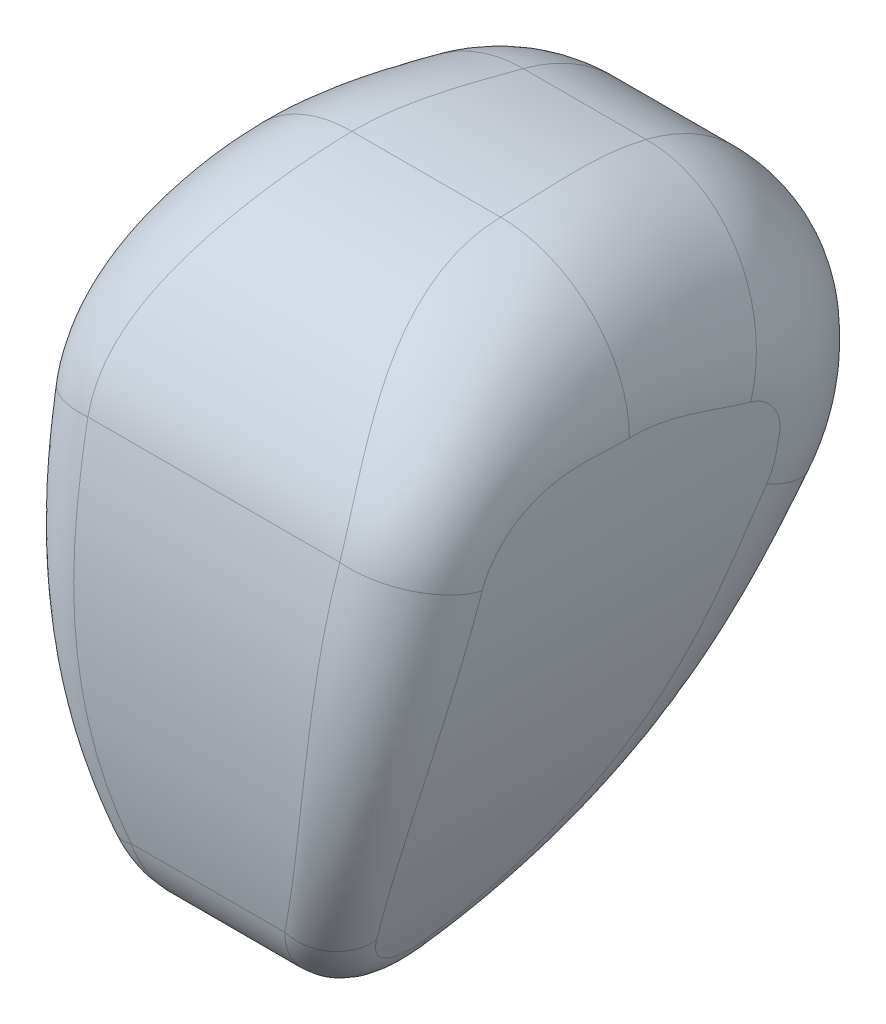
ISO-10303-21;
HEADER;
FILE_DESCRIPTION(('STEP AP214'),'2;1');
FILE_NAME('part.step','',(''),(''),'','','');
FILE_SCHEMA(('AUTOMOTIVE_DESIGN { 1 0 10303 214 1 1 1 1 }'));
ENDSEC;
DATA;
#1=APPLICATION_CONTEXT('core data for automotive mechanical design processes');
#2=APPLICATION_PROTOCOL_DEFINITION('international standard','automotive_design',2000,#1);
#3=PRODUCT_CONTEXT('',#1,'mechanical');
#4=PRODUCT('Part','Part','',(#3));
#5=PRODUCT_RELATED_PRODUCT_CATEGORY('part','',(#4));
#6=PRODUCT_DEFINITION_FORMATION('','',#4);
#7=PRODUCT_DEFINITION_CONTEXT('part definition',#1,'design');
#8=PRODUCT_DEFINITION('design','',#6,#7);
#9=PRODUCT_DEFINITION_SHAPE('','',#8);
#10=(LENGTH_UNIT() NAMED_UNIT(*) SI_UNIT(.MILLI.,.METRE.));
#11=(NAMED_UNIT(*) PLANE_ANGLE_UNIT() SI_UNIT($,.RADIAN.));
#12=(NAMED_UNIT(*) SI_UNIT($,.STERADIAN.) SOLID_ANGLE_UNIT());
#13=UNCERTAINTY_MEASURE_WITH_UNIT(LENGTH_MEASURE(1.E-05),#10,'distance_accuracy_value','');
#14=(GEOMETRIC_REPRESENTATION_CONTEXT(3) GLOBAL_UNCERTAINTY_ASSIGNED_CONTEXT((#13)) GLOBAL_UNIT_ASSIGNED_CONTEXT((#10,
#11,#12)) REPRESENTATION_CONTEXT('',''));
#15=CARTESIAN_POINT('',(0.,0.,0.));
#16=DIRECTION('',(0.,0.,1.));
#17=DIRECTION('',(1.,0.,0.));
#18=AXIS2_PLACEMENT_3D('',#15,#16,#17);
#19=CARTESIAN_POINT('',(104.14,316.316642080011,-8.7962122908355));
#20=DIRECTION('',(-1.,0.,0.));
#21=DIRECTION('',(0.,0.,1.));
#22=AXIS2_PLACEMENT_3D('',#19,#20,#21);
#23=CYLINDRICAL_SURFACE('',#22,254.);
#24=DIRECTION('',(-1.,0.,0.));
#25=VECTOR('',#24,1.);
#26=CARTESIAN_POINT('',(104.14,562.534545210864,-71.1880721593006));
#27=LINE('',#26,#25);
#28=CARTESIAN_POINT('',(25.8098432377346,562.534545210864,-71.1880721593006));
#29=VERTEX_POINT('',#28);
#30=CARTESIAN_POINT('',(-25.8098432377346,562.534545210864,-71.1880721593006));
#31=VERTEX_POINT('',#30);
#32=EDGE_CURVE('E432',#29,#31,#27,.T.);
#33=ORIENTED_EDGE('',*,*,#32,.T.);
#34=CARTESIAN_POINT('',(-31.2381189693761,570.280866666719,-4.53327550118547));
#35=CARTESIAN_POINT('',(-31.2432628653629,570.659501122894,-27.0904023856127));
#36=CARTESIAN_POINT('',(-26.0024931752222,568.030099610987,-49.5008859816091));
#37=CARTESIAN_POINT('',(-25.8098432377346,562.534545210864,-71.1880721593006));
#38=(BOUNDED_CURVE() B_SPLINE_CURVE(3,(#34,#35,#36,#37),.UNSPECIFIED.,.F.,
.F.) B_SPLINE_CURVE_WITH_KNOTS((4,4),(0.00153231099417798,0.0669992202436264),
.UNSPECIFIED.) CURVE() GEOMETRIC_REPRESENTATION_ITEM() RATIONAL_B_SPLINE_CURVE((1.,1.,1.,1.)) REPRESENTATION_ITEM(''));
#39=CARTESIAN_POINT('',(-31.2381189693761,570.280866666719,-4.53327550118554));
#40=VERTEX_POINT('',#39);
#41=EDGE_CURVE('E606',#31,#40,#38,.F.);
#42=ORIENTED_EDGE('',*,*,#41,.T.);
#43=DIRECTION('',(-1.,0.,0.));
#44=VECTOR('',#43,1.);
#45=CARTESIAN_POINT('',(104.14,570.280866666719,-4.53327550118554));
#46=LINE('',#45,#44);
#47=CARTESIAN_POINT('',(31.2381189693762,570.280866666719,-4.53327550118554));
#48=VERTEX_POINT('',#47);
#49=EDGE_CURVE('E158',#48,#40,#46,.T.);
#50=ORIENTED_EDGE('',*,*,#49,.F.);
#51=CARTESIAN_POINT('',(25.8098432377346,562.534545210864,-71.1880721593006));
#52=CARTESIAN_POINT('',(26.0024931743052,568.030099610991,-49.5008859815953));
#53=CARTESIAN_POINT('',(31.2432628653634,570.659501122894,-27.0904023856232));
#54=CARTESIAN_POINT('',(31.2381189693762,570.280866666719,-4.53327550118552));
#55=(BOUNDED_CURVE() B_SPLINE_CURVE(3,(#51,#52,#53,#54),.UNSPECIFIED.,.F.,
.F.) B_SPLINE_CURVE_WITH_KNOTS((4,4),(0.00153231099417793,0.0669992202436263),
.UNSPECIFIED.) CURVE() GEOMETRIC_REPRESENTATION_ITEM() RATIONAL_B_SPLINE_CURVE((1.,1.,1.,1.)) REPRESENTATION_ITEM(''));
#56=EDGE_CURVE('E232',#48,#29,#55,.F.);
#57=ORIENTED_EDGE('',*,*,#56,.T.);
#58=EDGE_LOOP('',(#33,#42,#50,#57));
#59=FACE_BOUND('',#58,.T.);
#60=ADVANCED_FACE('F33',(#59),#23,.T.);
#61=CARTESIAN_POINT('',(104.14,476.314103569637,-6.11056211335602));
#62=DIRECTION('',(-1.,0.,0.));
#63=DIRECTION('',(0.,0.,1.));
#64=AXIS2_PLACEMENT_3D('',#61,#62,#63);
#65=CYLINDRICAL_SURFACE('',#64,93.9799999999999);
#66=ORIENTED_EDGE('',*,*,#49,.T.);
#67=CARTESIAN_POINT('',(-52.982767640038,500.065226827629,84.8186661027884));
#68=CARTESIAN_POINT('',(-53.4434089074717,509.179044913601,82.4380958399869));
#69=CARTESIAN_POINT('',(-52.2803740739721,517.964838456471,78.6773962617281));
#70=CARTESIAN_POINT('',(-48.295915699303,534.197053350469,68.5442818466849));
#71=CARTESIAN_POINT('',(-45.4828771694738,541.395296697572,62.4001738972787));
#72=CARTESIAN_POINT('',(-39.8195411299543,554.187236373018,47.4156729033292));
#73=CARTESIAN_POINT('',(-36.9622620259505,559.538622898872,38.8873660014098));
#74=CARTESIAN_POINT('',(-32.6726893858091,567.630655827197,18.6365879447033));
#75=CARTESIAN_POINT('',(-31.2366318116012,570.080883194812,7.38072882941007));
#76=CARTESIAN_POINT('',(-31.2381189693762,570.280866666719,-4.53327550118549));
#77=(BOUNDED_CURVE() B_SPLINE_CURVE(3,(#67,#68,#69,#70,#71,#72,#73,#74,#75,#76),.UNSPECIFIED.,
.F.,.F.) B_SPLINE_CURVE_WITH_KNOTS((4,2,2,2,4),(-0.000178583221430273,0.0308652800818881,
0.0619091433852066,0.092953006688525,0.123996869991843),
.UNSPECIFIED.) CURVE() GEOMETRIC_REPRESENTATION_ITEM() RATIONAL_B_SPLINE_CURVE((1.,1.,1.,1.,1.,
1.,1.,1.,1.,1.)) REPRESENTATION_ITEM(''));
#78=CARTESIAN_POINT('',(-52.982767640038,500.065226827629,84.8186661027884));
#79=VERTEX_POINT('',#78);
#80=EDGE_CURVE('E682',#40,#79,#77,.F.);
#81=ORIENTED_EDGE('',*,*,#80,.T.);
#82=DIRECTION('',(-1.,0.,0.));
#83=VECTOR('',#82,1.);
#84=CARTESIAN_POINT('',(104.14,500.065226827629,84.8186661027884));
#85=LINE('',#84,#83);
#86=CARTESIAN_POINT('',(52.982767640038,500.065226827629,84.8186661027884));
#87=VERTEX_POINT('',#86);
#88=EDGE_CURVE('E175',#87,#79,#85,.T.);
#89=ORIENTED_EDGE('',*,*,#88,.F.);
#90=CARTESIAN_POINT('',(31.2381189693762,570.280866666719,-4.53327550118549));
#91=CARTESIAN_POINT('',(31.2366318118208,570.080883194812,7.38072882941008));
#92=CARTESIAN_POINT('',(32.6726893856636,567.630655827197,18.6365879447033));
#93=CARTESIAN_POINT('',(36.962262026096,559.538622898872,38.8873660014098));
#94=CARTESIAN_POINT('',(39.819541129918,554.187236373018,47.4156729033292));
#95=CARTESIAN_POINT('',(45.4828771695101,541.395296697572,62.4001738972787));
#96=CARTESIAN_POINT('',(48.295915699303,534.197053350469,68.5442818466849));
#97=CARTESIAN_POINT('',(52.2803740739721,517.964838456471,78.6773962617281));
#98=CARTESIAN_POINT('',(53.4434089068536,509.17904491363,82.4380958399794));
#99=CARTESIAN_POINT('',(52.982767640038,500.065226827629,84.8186661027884));
#100=(BOUNDED_CURVE() B_SPLINE_CURVE(3,(#90,#91,#92,#93,#94,#95,#96,#97,#98,#99),.UNSPECIFIED.,
.F.,.F.) B_SPLINE_CURVE_WITH_KNOTS((4,2,2,2,4),(-0.000178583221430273,0.0308652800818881,
0.0619091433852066,0.092953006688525,0.123996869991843),
.UNSPECIFIED.) CURVE() GEOMETRIC_REPRESENTATION_ITEM() RATIONAL_B_SPLINE_CURVE((1.,1.,1.,1.,1.,
1.,1.,1.,1.,1.)) REPRESENTATION_ITEM(''));
#101=EDGE_CURVE('E779',#87,#48,#100,.F.);
#102=ORIENTED_EDGE('',*,*,#101,.T.);
#103=EDGE_LOOP('',(#66,#81,#89,#102));
#104=FACE_BOUND('',#103,.T.);
#105=ADVANCED_FACE('F401',(#104),#65,.T.);
#106=CARTESIAN_POINT('',(104.14,423.03455680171,-210.086938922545));
#107=DIRECTION('',(-1.,0.,0.));
#108=DIRECTION('',(0.,0.,1.));
#109=AXIS2_PLACEMENT_3D('',#106,#107,#108);
#110=CYLINDRICAL_SURFACE('',#109,304.8);
#111=ORIENTED_EDGE('',*,*,#88,.T.);
#112=CARTESIAN_POINT('',(-32.3131315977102,356.243038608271,87.3049457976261));
#113=CARTESIAN_POINT('',(-36.6945407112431,367.744792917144,89.8881354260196));
#114=CARTESIAN_POINT('',(-40.1026642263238,379.702315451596,91.8638620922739));
#115=CARTESIAN_POINT('',(-45.2954825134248,403.981493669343,94.3616612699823));
#116=CARTESIAN_POINT('',(-47.1059236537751,416.394327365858,94.8874151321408));
#117=CARTESIAN_POINT('',(-50.936306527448,453.180506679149,94.2088034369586));
#118=CARTESIAN_POINT('',(-51.417990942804,476.822575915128,90.8897510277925));
#119=CARTESIAN_POINT('',(-52.9827676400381,500.065226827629,84.8186661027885));
#120=(BOUNDED_CURVE() B_SPLINE_CURVE(3,(#112,#113,#114,#115,#116,#117,#118,#119),.UNSPECIFIED.,
.F.,.F.) B_SPLINE_CURVE_WITH_KNOTS((4,2,2,4),(0.00186203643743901,0.0404248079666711,
0.0789875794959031,0.156113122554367),
.UNSPECIFIED.) CURVE() GEOMETRIC_REPRESENTATION_ITEM() RATIONAL_B_SPLINE_CURVE((1.,1.,1.,1.,1.,
1.,1.,1.)) REPRESENTATION_ITEM(''));
#121=CARTESIAN_POINT('',(-32.3131315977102,356.243038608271,87.304945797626));
#122=VERTEX_POINT('',#121);
#123=EDGE_CURVE('E384',#79,#122,#120,.F.);
#124=ORIENTED_EDGE('',*,*,#123,.T.);
#125=DIRECTION('',(-1.,0.,0.));
#126=VECTOR('',#125,1.);
#127=CARTESIAN_POINT('',(104.14,356.243038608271,87.304945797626));
#128=LINE('',#127,#126);
#129=CARTESIAN_POINT('',(32.3131315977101,356.243038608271,87.304945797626));
#130=VERTEX_POINT('',#129);
#131=EDGE_CURVE('E428',#130,#122,#128,.T.);
#132=ORIENTED_EDGE('',*,*,#131,.F.);
#133=CARTESIAN_POINT('',(52.9827676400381,500.065226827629,84.8186661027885));
#134=CARTESIAN_POINT('',(51.4179909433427,476.822575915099,90.8897510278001));
#135=CARTESIAN_POINT('',(50.936306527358,453.180506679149,94.2088034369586));
#136=CARTESIAN_POINT('',(47.1059236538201,416.394327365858,94.8874151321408));
#137=CARTESIAN_POINT('',(45.2954825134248,403.981493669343,94.3616612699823));
#138=CARTESIAN_POINT('',(40.1026642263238,379.702315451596,91.8638620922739));
#139=CARTESIAN_POINT('',(36.6945407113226,367.744792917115,89.8881354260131));
#140=CARTESIAN_POINT('',(32.3131315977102,356.243038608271,87.3049457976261));
#141=(BOUNDED_CURVE() B_SPLINE_CURVE(3,(#133,#134,#135,#136,#137,#138,#139,#140),.UNSPECIFIED.,
.F.,.F.) B_SPLINE_CURVE_WITH_KNOTS((4,2,2,4),(0.00186203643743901,0.0789875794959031,
0.117550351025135,0.156113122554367),
.UNSPECIFIED.) CURVE() GEOMETRIC_REPRESENTATION_ITEM() RATIONAL_B_SPLINE_CURVE((1.,1.,1.,1.,1.,
1.,1.,1.)) REPRESENTATION_ITEM(''));
#142=EDGE_CURVE('E138',#130,#87,#141,.F.);
#143=ORIENTED_EDGE('',*,*,#142,.T.);
#144=EDGE_LOOP('',(#111,#124,#132,#143));
#145=FACE_BOUND('',#144,.T.);
#146=ADVANCED_FACE('F390',(#145),#110,.T.);
#147=CARTESIAN_POINT('',(104.14,365.705170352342,45.1744287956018));
#148=DIRECTION('',(-1.,0.,0.));
#149=DIRECTION('',(0.,0.,1.));
#150=AXIS2_PLACEMENT_3D('',#147,#148,#149);
#151=CYLINDRICAL_SURFACE('',#150,43.18);
#152=ORIENTED_EDGE('',*,*,#131,.T.);
#153=CARTESIAN_POINT('',(-24.897575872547,323.936134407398,34.226367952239));
#154=CARTESIAN_POINT('',(-24.5221446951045,322.392724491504,40.1147846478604));
#155=CARTESIAN_POINT('',(-24.4555739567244,322.123133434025,46.3719269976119));
#156=CARTESIAN_POINT('',(-24.9418108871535,324.116275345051,58.2584555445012));
#157=CARTESIAN_POINT('',(-25.5023331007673,326.415314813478,64.004386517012));
#158=CARTESIAN_POINT('',(-27.0215953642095,332.788867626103,73.7187289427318));
#159=CARTESIAN_POINT('',(-28.0019438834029,336.961711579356,77.8652075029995));
#160=CARTESIAN_POINT('',(-30.0861294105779,346.092294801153,84.0358305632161));
#161=CARTESIAN_POINT('',(-31.2086920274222,351.131690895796,86.1569834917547));
#162=CARTESIAN_POINT('',(-32.3131315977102,356.243038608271,87.3049457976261));
#163=(BOUNDED_CURVE() B_SPLINE_CURVE(3,(#153,#154,#155,#156,#157,#158,#159,#160,#161,#162),
.UNSPECIFIED.,.F.,.F.) B_SPLINE_CURVE_WITH_KNOTS((4,2,2,2,4),(0.0121747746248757,
0.026361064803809,0.0405473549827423,0.0547336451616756,0.0689199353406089),
.UNSPECIFIED.) CURVE() GEOMETRIC_REPRESENTATION_ITEM() RATIONAL_B_SPLINE_CURVE((1.,1.,1.,1.,1.,
1.,1.,1.,1.,1.)) REPRESENTATION_ITEM(''));
#164=CARTESIAN_POINT('',(-24.897575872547,323.936134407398,34.2263679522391));
#165=VERTEX_POINT('',#164);
#166=EDGE_CURVE('E11',#122,#165,#163,.F.);
#167=ORIENTED_EDGE('',*,*,#166,.T.);
#168=DIRECTION('',(-1.,0.,0.));
#169=VECTOR('',#168,1.);
#170=CARTESIAN_POINT('',(104.14,323.936134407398,34.2263679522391));
#171=LINE('',#170,#169);
#172=CARTESIAN_POINT('',(24.897575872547,323.936134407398,34.2263679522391));
#173=VERTEX_POINT('',#172);
#174=EDGE_CURVE('E429',#173,#165,#171,.T.);
#175=ORIENTED_EDGE('',*,*,#174,.F.);
#176=CARTESIAN_POINT('',(32.3131315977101,356.243038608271,87.3049457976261));
#177=CARTESIAN_POINT('',(31.2086920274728,351.131690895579,86.1569834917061));
#178=CARTESIAN_POINT('',(30.0861294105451,346.092294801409,84.0358305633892));
#179=CARTESIAN_POINT('',(28.0019438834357,336.9617115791,77.8652075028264));
#180=CARTESIAN_POINT('',(27.0215953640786,332.788867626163,73.7187289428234));
#181=CARTESIAN_POINT('',(25.5023331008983,326.415314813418,64.0043865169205));
#182=CARTESIAN_POINT('',(24.941810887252,324.116275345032,58.2584555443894));
#183=CARTESIAN_POINT('',(24.455573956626,322.123133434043,46.3719269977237));
#184=CARTESIAN_POINT('',(24.5221446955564,322.392724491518,40.1147846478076));
#185=CARTESIAN_POINT('',(24.897575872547,323.936134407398,34.2263679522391));
#186=(BOUNDED_CURVE() B_SPLINE_CURVE(3,(#176,#177,#178,#179,#180,#181,#182,#183,#184,#185),
.UNSPECIFIED.,.F.,.F.) B_SPLINE_CURVE_WITH_KNOTS((4,2,2,2,4),(0.0121747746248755,
0.0263610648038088,0.0405473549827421,0.0547336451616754,0.0689199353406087),
.UNSPECIFIED.) CURVE() GEOMETRIC_REPRESENTATION_ITEM() RATIONAL_B_SPLINE_CURVE((1.,1.,1.,1.,1.,
1.,1.,1.,1.,1.)) REPRESENTATION_ITEM(''));
#187=EDGE_CURVE('E778',#173,#130,#186,.F.);
#188=ORIENTED_EDGE('',*,*,#187,.T.);
#189=EDGE_LOOP('',(#152,#167,#175,#188));
#190=FACE_BOUND('',#189,.T.);
#191=ADVANCED_FACE('F400',(#190),#151,.T.);
#192=CARTESIAN_POINT('',(104.14,569.636345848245,98.6267258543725));
#193=DIRECTION('',(-1.,0.,0.));
#194=DIRECTION('',(0.,0.,1.));
#195=AXIS2_PLACEMENT_3D('',#192,#193,#194);
#196=CYLINDRICAL_SURFACE('',#195,254.);
#197=ORIENTED_EDGE('',*,*,#174,.T.);
#198=CARTESIAN_POINT('',(-18.0470053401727,443.325272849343,-121.740043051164));
#199=CARTESIAN_POINT('',(-16.8185509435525,430.417024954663,-114.341220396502));
#200=CARTESIAN_POINT('',(-17.6928794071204,416.970760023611,-105.072837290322));
#201=CARTESIAN_POINT('',(-20.5947696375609,391.385048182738,-83.1059569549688));
#202=CARTESIAN_POINT('',(-22.5992460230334,379.24673110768,-70.416454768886));
#203=CARTESIAN_POINT('',(-24.8943881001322,363.171698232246,-49.580223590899));
#204=CARTESIAN_POINT('',(-25.5506485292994,358.162864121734,-42.3330841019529));
#205=CARTESIAN_POINT('',(-26.5527185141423,349.070072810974,-27.6318211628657));
#206=CARTESIAN_POINT('',(-26.8926717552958,344.95820551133,-20.1458986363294));
#207=CARTESIAN_POINT('',(-27.2731453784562,333.877016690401,2.61448179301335));
#208=CARTESIAN_POINT('',(-26.6763316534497,328.14410828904,18.1721082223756));
#209=CARTESIAN_POINT('',(-24.897575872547,323.936134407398,34.226367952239));
#210=(BOUNDED_CURVE() B_SPLINE_CURVE(3,(#198,#199,#200,#201,#202,#203,#204,#205,#206,#207,#208,
#209),.UNSPECIFIED.,.F.,.F.) B_SPLINE_CURVE_WITH_KNOTS((4,2,2,2,2,4),(-0.00170403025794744,
0.0464530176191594,0.0946100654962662,0.11868858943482,0.142767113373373,0.19092416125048),
.UNSPECIFIED.) CURVE() GEOMETRIC_REPRESENTATION_ITEM() RATIONAL_B_SPLINE_CURVE((1.,1.,1.,1.,1.,
1.,1.,1.,1.,1.,1.,1.)) REPRESENTATION_ITEM(''));
#211=CARTESIAN_POINT('',(-18.0470053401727,443.325272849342,-121.740043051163));
#212=VERTEX_POINT('',#211);
#213=EDGE_CURVE('E46',#165,#212,#210,.F.);
#214=ORIENTED_EDGE('',*,*,#213,.T.);
#215=DIRECTION('',(-1.,0.,0.));
#216=VECTOR('',#215,1.);
#217=CARTESIAN_POINT('',(104.14,443.325272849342,-121.740043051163));
#218=LINE('',#217,#216);
#219=CARTESIAN_POINT('',(18.0470053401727,443.325272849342,-121.740043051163));
#220=VERTEX_POINT('',#219);
#221=EDGE_CURVE('E430',#220,#212,#218,.T.);
#222=ORIENTED_EDGE('',*,*,#221,.F.);
#223=CARTESIAN_POINT('',(24.897575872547,323.936134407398,34.226367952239));
#224=CARTESIAN_POINT('',(26.6763316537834,328.144108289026,18.1721082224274));
#225=CARTESIAN_POINT('',(27.273145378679,333.877016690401,2.61448179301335));
#226=CARTESIAN_POINT('',(26.8926717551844,344.95820551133,-20.1458986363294));
#227=CARTESIAN_POINT('',(26.5527185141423,349.070072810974,-27.6318211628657));
#228=CARTESIAN_POINT('',(25.5506485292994,358.162864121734,-42.3330841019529));
#229=CARTESIAN_POINT('',(24.894388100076,363.171698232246,-49.580223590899));
#230=CARTESIAN_POINT('',(22.5992460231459,379.24673110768,-70.416454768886));
#231=CARTESIAN_POINT('',(20.5947696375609,391.385048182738,-83.1059569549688));
#232=CARTESIAN_POINT('',(17.6928794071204,416.970760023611,-105.072837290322));
#233=CARTESIAN_POINT('',(16.8185509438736,430.41702495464,-114.341220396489));
#234=CARTESIAN_POINT('',(18.0470053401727,443.325272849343,-121.740043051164));
#235=(BOUNDED_CURVE() B_SPLINE_CURVE(3,(#223,#224,#225,#226,#227,#228,#229,#230,#231,#232,#233,
#234),.UNSPECIFIED.,.F.,.F.) B_SPLINE_CURVE_WITH_KNOTS((4,2,2,2,2,4),(-0.00170403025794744,
0.0464530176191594,0.0705315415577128,0.0946100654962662,0.142767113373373,0.19092416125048),
.UNSPECIFIED.) CURVE() GEOMETRIC_REPRESENTATION_ITEM() RATIONAL_B_SPLINE_CURVE((1.,1.,1.,1.,1.,
1.,1.,1.,1.,1.,1.,1.)) REPRESENTATION_ITEM(''));
#236=EDGE_CURVE('E301',#220,#173,#235,.F.);
#237=ORIENTED_EDGE('',*,*,#236,.T.);
#238=EDGE_LOOP('',(#197,#214,#222,#237));
#239=FACE_BOUND('',#238,.T.);
#240=ADVANCED_FACE('F444',(#239),#196,.T.);
#241=CARTESIAN_POINT('',(104.14,483.744816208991,-51.2226770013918));
#242=DIRECTION('',(-1.,0.,0.));
#243=DIRECTION('',(0.,0.,1.));
#244=AXIS2_PLACEMENT_3D('',#241,#242,#243);
#245=CYLINDRICAL_SURFACE('',#244,81.28);
#246=ORIENTED_EDGE('',*,*,#221,.T.);
#247=CARTESIAN_POINT('',(-25.8098432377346,562.534545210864,-71.1880721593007));
#248=CARTESIAN_POINT('',(-25.7799178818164,560.19742982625,-80.411064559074));
#249=CARTESIAN_POINT('',(-25.6444481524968,556.246033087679,-88.9113200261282));
#250=CARTESIAN_POINT('',(-25.215307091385,547.016405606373,-102.929216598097));
#251=CARTESIAN_POINT('',(-24.9211609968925,541.734185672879,-108.565543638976));
#252=CARTESIAN_POINT('',(-24.2432972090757,531.604676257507,-117.256040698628));
#253=CARTESIAN_POINT('',(-23.8630307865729,526.900937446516,-120.259986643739));
#254=CARTESIAN_POINT('',(-23.0791773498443,518.641860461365,-124.780798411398));
#255=CARTESIAN_POINT('',(-22.6799162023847,515.282993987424,-126.204332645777));
#256=CARTESIAN_POINT('',(-21.8957870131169,509.223526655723,-128.473830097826));
#257=CARTESIAN_POINT('',(-21.5122677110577,506.592748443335,-129.287764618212));
#258=CARTESIAN_POINT('',(-20.7699252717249,500.537040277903,-130.810409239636));
#259=CARTESIAN_POINT('',(-20.4096273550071,497.033003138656,-131.560632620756));
#260=CARTESIAN_POINT('',(-19.8815164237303,489.674450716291,-132.323595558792));
#261=CARTESIAN_POINT('',(-19.7070232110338,486.851258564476,-132.511096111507));
#262=CARTESIAN_POINT('',(-19.3580358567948,480.212406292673,-132.49369979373));
#263=CARTESIAN_POINT('',(-19.1840316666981,476.419919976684,-132.282588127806));
#264=CARTESIAN_POINT('',(-18.6706064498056,463.846708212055,-130.483028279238));
#265=CARTESIAN_POINT('',(-18.3375183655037,453.791425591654,-127.739091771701));
#266=CARTESIAN_POINT('',(-18.0470053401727,443.325272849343,-121.740043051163));
#267=(BOUNDED_CURVE() B_SPLINE_CURVE(3,(#247,#248,#249,#250,#251,#252,#253,#254,#255,#256,#257,
#258,#259,#260,#261,#262,#263,#264,#265,#266),.UNSPECIFIED.,.F.,
.F.) B_SPLINE_CURVE_WITH_KNOTS((4,2,2,2,2,2,2,2,2,4),(-0.0356702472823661,-0.0120856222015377,
0.0114990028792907,0.0350836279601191,0.0586682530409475,0.0822528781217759,0.105837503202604,
0.117629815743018,0.129422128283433,0.153006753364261),
.UNSPECIFIED.) CURVE() GEOMETRIC_REPRESENTATION_ITEM() RATIONAL_B_SPLINE_CURVE((1.,1.,1.,1.,1.,
1.,1.,1.,1.,1.,1.,1.,1.,1.,1.,1.,1.,1.,1.,1.)) REPRESENTATION_ITEM(''));
#268=EDGE_CURVE('E655',#212,#31,#267,.F.);
#269=ORIENTED_EDGE('',*,*,#268,.T.);
#270=ORIENTED_EDGE('',*,*,#32,.F.);
#271=CARTESIAN_POINT('',(18.0470053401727,443.325272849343,-121.740043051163));
#272=CARTESIAN_POINT('',(18.3375183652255,453.791425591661,-127.739091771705));
#273=CARTESIAN_POINT('',(18.6706064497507,463.846708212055,-130.483028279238));
#274=CARTESIAN_POINT('',(19.1840316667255,476.419919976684,-132.282588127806));
#275=CARTESIAN_POINT('',(19.3580358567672,480.212406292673,-132.49369979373));
#276=CARTESIAN_POINT('',(19.7070232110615,486.851258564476,-132.511096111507));
#277=CARTESIAN_POINT('',(19.8815164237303,489.674450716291,-132.323595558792));
#278=CARTESIAN_POINT('',(20.4096273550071,497.033003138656,-131.560632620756));
#279=CARTESIAN_POINT('',(20.7699252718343,500.537040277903,-130.810409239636));
#280=CARTESIAN_POINT('',(21.5122677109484,506.592748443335,-129.287764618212));
#281=CARTESIAN_POINT('',(21.8957870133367,509.223526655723,-128.473830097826));
#282=CARTESIAN_POINT('',(22.6799162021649,515.282993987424,-126.204332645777));
#283=CARTESIAN_POINT('',(23.0791773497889,518.641860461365,-124.780798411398));
#284=CARTESIAN_POINT('',(23.8630307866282,526.900937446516,-120.259986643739));
#285=CARTESIAN_POINT('',(24.2432972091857,531.604676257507,-117.256040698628));
#286=CARTESIAN_POINT('',(24.9211609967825,541.734185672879,-108.565543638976));
#287=CARTESIAN_POINT('',(25.215307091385,547.016405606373,-102.929216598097));
#288=CARTESIAN_POINT('',(25.6444481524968,556.246033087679,-88.9113200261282));
#289=CARTESIAN_POINT('',(25.7799178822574,560.197429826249,-80.4110645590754));
#290=CARTESIAN_POINT('',(25.8098432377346,562.534545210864,-71.1880721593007));
#291=(BOUNDED_CURVE() B_SPLINE_CURVE(3,(#271,#272,#273,#274,#275,#276,#277,#278,#279,#280,#281,
#282,#283,#284,#285,#286,#287,#288,#289,#290),.UNSPECIFIED.,.F.,
.F.) B_SPLINE_CURVE_WITH_KNOTS((4,2,2,2,2,2,2,2,2,4),(-0.0356702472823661,-0.0120856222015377,
-0.000293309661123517,0.0114990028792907,0.0350836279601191,0.0586682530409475,
0.0822528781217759,0.105837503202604,0.129422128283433,0.153006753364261),
.UNSPECIFIED.) CURVE() GEOMETRIC_REPRESENTATION_ITEM() RATIONAL_B_SPLINE_CURVE((1.,1.,1.,1.,1.,
1.,1.,1.,1.,1.,1.,1.,1.,1.,1.,1.,1.,1.,1.,1.)) REPRESENTATION_ITEM(''));
#292=EDGE_CURVE('E777',#29,#220,#291,.F.);
#293=ORIENTED_EDGE('',*,*,#292,.T.);
#294=EDGE_LOOP('',(#246,#269,#270,#293));
#295=FACE_BOUND('',#294,.T.);
#296=ADVANCED_FACE('F188',(#295),#245,.T.);
#297=CARTESIAN_POINT('',(-367.316847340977,523.802207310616,500.022493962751));
#298=DIRECTION('',(0.,0.,-1.));
#299=DIRECTION('',(-1.,0.,0.));
#300=AXIS2_PLACEMENT_3D('',#297,#298,#299);
#301=CYLINDRICAL_SURFACE('',#300,451.953893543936);
#302=CARTESIAN_POINT('',(83.37784657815,490.088489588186,55.328105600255));
#303=CARTESIAN_POINT('',(83.873644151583,496.716454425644,53.71360804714));
#304=CARTESIAN_POINT('',(84.1542734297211,502.482879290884,49.7740547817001));
#305=CARTESIAN_POINT('',(84.4773612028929,511.047609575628,39.6765403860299));
#306=CARTESIAN_POINT('',(84.5255682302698,513.660391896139,33.7033807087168));
#307=CARTESIAN_POINT('',(84.5813476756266,516.560227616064,21.6905736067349));
#308=CARTESIAN_POINT('',(84.5814095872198,516.709551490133,15.8534619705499));
#309=CARTESIAN_POINT('',(84.5770596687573,516.437617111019,4.73623182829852));
#310=CARTESIAN_POINT('',(84.5685622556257,515.934047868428,-0.321461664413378));
#311=CARTESIAN_POINT('',(84.5702336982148,516.031243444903,-5.42849222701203));
#312=(BOUNDED_CURVE() B_SPLINE_CURVE(3,(#302,#303,#304,#305,#306,#307,#308,#309,#310,#311),
.UNSPECIFIED.,.F.,.F.) B_SPLINE_CURVE_WITH_KNOTS((4,2,2,2,4),(-0.000178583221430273,
0.0308652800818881,0.0619091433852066,0.092953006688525,0.123996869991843),
.UNSPECIFIED.) CURVE() GEOMETRIC_REPRESENTATION_ITEM() RATIONAL_B_SPLINE_CURVE((1.,1.,1.,1.,1.,
1.,1.,1.,1.,1.)) REPRESENTATION_ITEM(''));
#313=CARTESIAN_POINT('',(84.5702336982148,516.031243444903,-5.42849222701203));
#314=VERTEX_POINT('',#313);
#315=CARTESIAN_POINT('',(83.37784657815,490.088489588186,55.328105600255));
#316=VERTEX_POINT('',#315);
#317=EDGE_CURVE('E164',#314,#316,#312,.F.);
#318=ORIENTED_EDGE('',*,*,#317,.T.);
#319=CARTESIAN_POINT('',(51.1264854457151,353.017257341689,67.4788201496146));
#320=CARTESIAN_POINT('',(55.71458957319,364.258655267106,69.8900240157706));
#321=CARTESIAN_POINT('',(59.9031042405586,375.834221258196,71.1086473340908));
#322=CARTESIAN_POINT('',(67.2692506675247,399.117262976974,71.5319190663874));
#323=CARTESIAN_POINT('',(70.4721686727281,410.911262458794,70.7426695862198));
#324=CARTESIAN_POINT('',(78.4647887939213,445.660546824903,66.3112569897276));
#325=CARTESIAN_POINT('',(81.7021978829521,467.687934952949,60.7846283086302));
#326=CARTESIAN_POINT('',(83.37784657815,490.088489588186,55.3281056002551));
#327=(BOUNDED_CURVE() B_SPLINE_CURVE(3,(#319,#320,#321,#322,#323,#324,#325,#326),.UNSPECIFIED.,
.F.,.F.) B_SPLINE_CURVE_WITH_KNOTS((4,2,2,4),(0.00186203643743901,0.0404248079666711,
0.0789875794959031,0.156113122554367),
.UNSPECIFIED.) CURVE() GEOMETRIC_REPRESENTATION_ITEM() RATIONAL_B_SPLINE_CURVE((1.,1.,1.,1.,1.,
1.,1.,1.)) REPRESENTATION_ITEM(''));
#328=CARTESIAN_POINT('',(51.1264854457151,353.017257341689,67.4788201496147));
#329=VERTEX_POINT('',#328);
#330=EDGE_CURVE('E135',#316,#329,#327,.F.);
#331=ORIENTED_EDGE('',*,*,#330,.T.);
#332=CARTESIAN_POINT('',(43.3618280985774,335.108414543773,39.3783965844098));
#333=CARTESIAN_POINT('',(42.9686589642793,334.25270976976,42.4962996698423));
#334=CARTESIAN_POINT('',(42.8990180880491,334.103404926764,45.8083984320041));
#335=CARTESIAN_POINT('',(43.4081455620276,335.208272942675,52.1012664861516));
#336=CARTESIAN_POINT('',(43.9950554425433,336.482710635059,55.1432299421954));
#337=CARTESIAN_POINT('',(45.5858399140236,340.015793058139,60.2861171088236));
#338=CARTESIAN_POINT('',(46.6123402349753,342.328945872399,62.4813116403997));
#339=CARTESIAN_POINT('',(48.7946428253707,347.390346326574,65.7481120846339));
#340=CARTESIAN_POINT('',(49.9700829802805,350.183934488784,66.8710915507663));
#341=CARTESIAN_POINT('',(51.126485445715,353.017257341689,67.4788201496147));
#342=(BOUNDED_CURVE() B_SPLINE_CURVE(3,(#332,#333,#334,#335,#336,#337,#338,#339,#340,#341),
.UNSPECIFIED.,.F.,.F.) B_SPLINE_CURVE_WITH_KNOTS((4,2,2,2,4),(0.0121747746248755,
0.0263610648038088,0.0405473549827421,0.0547336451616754,0.0689199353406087),
.UNSPECIFIED.) CURVE() GEOMETRIC_REPRESENTATION_ITEM() RATIONAL_B_SPLINE_CURVE((1.,1.,1.,1.,1.,
1.,1.,1.,1.,1.)) REPRESENTATION_ITEM(''));
#343=CARTESIAN_POINT('',(43.3618280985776,335.108414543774,39.3783965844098));
#344=VERTEX_POINT('',#343);
#345=EDGE_CURVE('E148',#329,#344,#342,.F.);
#346=ORIENTED_EDGE('',*,*,#345,.T.);
#347=CARTESIAN_POINT('',(81.0418807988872,466.909564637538,-66.6483508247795));
#348=CARTESIAN_POINT('',(79.6149066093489,455.663886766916,-61.1081398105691));
#349=CARTESIAN_POINT('',(77.5095876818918,442.686377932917,-56.4873029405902));
#350=CARTESIAN_POINT('',(71.774054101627,415.869286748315,-45.5714738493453));
#351=CARTESIAN_POINT('',(68.1313560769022,402.035964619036,-39.2273423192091));
#352=CARTESIAN_POINT('',(62.1420657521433,382.832982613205,-26.7745707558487));
#353=CARTESIAN_POINT('',(60.0667826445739,376.690935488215,-22.1433306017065));
#354=CARTESIAN_POINT('',(56.00083207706,365.370405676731,-12.0706812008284));
#355=CARTESIAN_POINT('',(54.0034718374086,360.166778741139,-6.6031787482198));
#356=CARTESIAN_POINT('',(48.4135971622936,346.233372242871,11.0737623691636));
#357=CARTESIAN_POINT('',(45.228404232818,339.170885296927,24.5761067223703));
#358=CARTESIAN_POINT('',(43.3618280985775,335.108414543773,39.3783965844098));
#359=(BOUNDED_CURVE() B_SPLINE_CURVE(3,(#347,#348,#349,#350,#351,#352,#353,#354,#355,#356,#357,
#358),.UNSPECIFIED.,.F.,.F.) B_SPLINE_CURVE_WITH_KNOTS((4,2,2,2,2,4),(-0.00170403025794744,
0.0464530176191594,0.0946100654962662,0.11868858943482,0.142767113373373,0.19092416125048),
.UNSPECIFIED.) CURVE() GEOMETRIC_REPRESENTATION_ITEM() RATIONAL_B_SPLINE_CURVE((1.,1.,1.,1.,1.,
1.,1.,1.,1.,1.,1.,1.)) REPRESENTATION_ITEM(''));
#360=CARTESIAN_POINT('',(81.0418807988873,466.909564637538,-66.6483508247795));
#361=VERTEX_POINT('',#360);
#362=EDGE_CURVE('E157',#344,#361,#359,.F.);
#363=ORIENTED_EDGE('',*,*,#362,.T.);
#364=CARTESIAN_POINT('',(84.1693940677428,503.247506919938,-56.8379443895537));
#365=CARTESIAN_POINT('',(84.1350104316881,502.492266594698,-59.4331088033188));
#366=CARTESIAN_POINT('',(84.0705208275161,501.121935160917,-61.7977807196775));
#367=CARTESIAN_POINT('',(83.896169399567,497.883788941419,-65.5498934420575));
#368=CARTESIAN_POINT('',(83.7857632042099,496.018508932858,-66.9710962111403));
#369=CARTESIAN_POINT('',(83.5525782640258,492.461176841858,-68.9689765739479));
#370=CARTESIAN_POINT('',(83.4337665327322,490.813112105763,-69.535280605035));
#371=CARTESIAN_POINT('',(83.2143543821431,487.940910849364,-70.1951580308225));
#372=CARTESIAN_POINT('',(83.1187557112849,486.772913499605,-70.2654206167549));
#373=CARTESIAN_POINT('',(82.9437678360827,484.702597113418,-70.2381355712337));
#374=CARTESIAN_POINT('',(82.8659489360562,483.818636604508,-70.1318534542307));
#375=CARTESIAN_POINT('',(82.6927539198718,481.914324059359,-69.9177009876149));
#376=CARTESIAN_POINT('',(82.5956676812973,480.873072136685,-69.8180104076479));
#377=CARTESIAN_POINT('',(82.3952132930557,478.837227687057,-69.637076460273));
#378=CARTESIAN_POINT('',(82.3186613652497,478.074653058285,-69.570113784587));
#379=CARTESIAN_POINT('',(82.1367489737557,476.319950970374,-69.3727321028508));
#380=CARTESIAN_POINT('',(82.0319561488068,475.334199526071,-69.2409752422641));
#381=CARTESIAN_POINT('',(81.6757607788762,472.104508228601,-68.6362312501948));
#382=CARTESIAN_POINT('',(81.3795962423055,469.571027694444,-67.9595271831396));
#383=CARTESIAN_POINT('',(81.0418807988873,466.909564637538,-66.6483508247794));
#384=(BOUNDED_CURVE() B_SPLINE_CURVE(3,(#364,#365,#366,#367,#368,#369,#370,#371,#372,#373,#374,
#375,#376,#377,#378,#379,#380,#381,#382,#383),.UNSPECIFIED.,.F.,
.F.) B_SPLINE_CURVE_WITH_KNOTS((4,2,2,2,2,2,2,2,2,4),(-0.0356702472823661,-0.0120856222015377,
0.0114990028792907,0.0350836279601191,0.0586682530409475,0.0822528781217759,0.105837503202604,
0.117629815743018,0.129422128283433,0.153006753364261),
.UNSPECIFIED.) CURVE() GEOMETRIC_REPRESENTATION_ITEM() RATIONAL_B_SPLINE_CURVE((1.,1.,1.,1.,1.,
1.,1.,1.,1.,1.,1.,1.,1.,1.,1.,1.,1.,1.,1.,1.)) REPRESENTATION_ITEM(''));
#385=CARTESIAN_POINT('',(84.1693940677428,503.247506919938,-56.8379443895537));
#386=VERTEX_POINT('',#385);
#387=EDGE_CURVE('E222',#361,#386,#384,.F.);
#388=ORIENTED_EDGE('',*,*,#387,.T.);
#389=CARTESIAN_POINT('',(84.5702336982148,516.031243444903,-5.42849222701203));
#390=CARTESIAN_POINT('',(84.5761387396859,516.374625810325,-23.4711262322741));
#391=CARTESIAN_POINT('',(84.3886345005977,508.06314699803,-40.290393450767));
#392=CARTESIAN_POINT('',(84.1693940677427,503.247506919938,-56.8379443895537));
#393=(BOUNDED_CURVE() B_SPLINE_CURVE(3,(#389,#390,#391,#392),.UNSPECIFIED.,.F.,
.F.) B_SPLINE_CURVE_WITH_KNOTS((4,4),(0.00153231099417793,0.0669992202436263),
.UNSPECIFIED.) CURVE() GEOMETRIC_REPRESENTATION_ITEM() RATIONAL_B_SPLINE_CURVE((1.,1.,1.,1.)) REPRESENTATION_ITEM(''));
#394=EDGE_CURVE('E219',#386,#314,#393,.F.);
#395=ORIENTED_EDGE('',*,*,#394,.T.);
#396=EDGE_LOOP('',(#318,#331,#346,#363,#388,#395));
#397=FACE_BOUND('',#396,.T.);
#398=ADVANCED_FACE('F162',(#397),#301,.T.);
#399=CARTESIAN_POINT('',(81.0418807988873,466.909564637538,-66.6483508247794));
#400=CARTESIAN_POINT('',(81.3795962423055,469.571027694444,-67.9595271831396));
#401=CARTESIAN_POINT('',(81.6757607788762,472.104508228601,-68.6362312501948));
#402=CARTESIAN_POINT('',(82.0319561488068,475.334199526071,-69.2409752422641));
#403=CARTESIAN_POINT('',(82.1367489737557,476.319950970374,-69.3727321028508));
#404=CARTESIAN_POINT('',(82.3186613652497,478.074653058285,-69.570113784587));
#405=CARTESIAN_POINT('',(82.3952132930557,478.837227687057,-69.637076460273));
#406=CARTESIAN_POINT('',(82.5956676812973,480.873072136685,-69.8180104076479));
#407=CARTESIAN_POINT('',(82.6927539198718,481.914324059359,-69.9177009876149));
#408=CARTESIAN_POINT('',(82.8659489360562,483.818636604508,-70.1318534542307));
#409=CARTESIAN_POINT('',(82.9437678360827,484.702597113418,-70.2381355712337));
#410=CARTESIAN_POINT('',(83.1187557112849,486.772913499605,-70.2654206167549));
#411=CARTESIAN_POINT('',(83.2143543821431,487.940910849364,-70.1951580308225));
#412=CARTESIAN_POINT('',(83.4337665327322,490.813112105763,-69.535280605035));
#413=CARTESIAN_POINT('',(83.5525782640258,492.461176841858,-68.9689765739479));
#414=CARTESIAN_POINT('',(83.7857632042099,496.018508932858,-66.9710962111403));
#415=CARTESIAN_POINT('',(83.896169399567,497.883788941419,-65.5498934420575));
#416=CARTESIAN_POINT('',(84.0705208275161,501.121935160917,-61.7977807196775));
#417=CARTESIAN_POINT('',(84.1350104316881,502.492266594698,-59.4331088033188));
#418=CARTESIAN_POINT('',(84.1693940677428,503.247506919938,-56.8379443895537));
#419=CARTESIAN_POINT('',(77.3307576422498,437.662998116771,-118.494508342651));
#420=CARTESIAN_POINT('',(78.7337874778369,447.328630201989,-125.151178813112));
#421=CARTESIAN_POINT('',(79.9814751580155,457.125782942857,-128.809444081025));
#422=CARTESIAN_POINT('',(81.4360887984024,469.739514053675,-131.682265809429));
#423=CARTESIAN_POINT('',(81.855585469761,473.610994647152,-132.211028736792));
#424=CARTESIAN_POINT('',(82.5659523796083,480.456879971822,-132.759713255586));
#425=CARTESIAN_POINT('',(82.8549449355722,483.406223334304,-132.785184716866));
#426=CARTESIAN_POINT('',(83.5874353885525,491.145825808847,-132.547687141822));
#427=CARTESIAN_POINT('',(83.9069489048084,494.905655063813,-132.006165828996));
#428=CARTESIAN_POINT('',(84.4360153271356,501.440795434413,-130.803365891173));
#429=CARTESIAN_POINT('',(84.6513690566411,504.306404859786,-130.104895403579));
#430=CARTESIAN_POINT('',(85.1091547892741,510.920883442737,-128.048687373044));
#431=CARTESIAN_POINT('',(85.3459969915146,514.597044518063,-126.719952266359));
#432=CARTESIAN_POINT('',(85.8463073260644,523.642331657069,-122.318542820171));
#433=CARTESIAN_POINT('',(86.0934512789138,528.800233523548,-119.329935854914));
#434=CARTESIAN_POINT('',(86.5019521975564,539.87809360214,-110.490101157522));
#435=CARTESIAN_POINT('',(86.6512706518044,545.636282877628,-104.684533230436));
#436=CARTESIAN_POINT('',(86.8214145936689,555.62967025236,-90.1882523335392));
#437=CARTESIAN_POINT('',(86.8462243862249,559.869296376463,-81.3807188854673));
#438=CARTESIAN_POINT('',(86.8609050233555,562.366839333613,-71.8498922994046));
#439=CARTESIAN_POINT('',(18.0470053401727,443.325272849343,-121.740043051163));
#440=CARTESIAN_POINT('',(18.3375183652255,453.791425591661,-127.739091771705));
#441=CARTESIAN_POINT('',(18.6706064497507,463.846708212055,-130.483028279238));
#442=CARTESIAN_POINT('',(19.1840316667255,476.419919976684,-132.282588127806));
#443=CARTESIAN_POINT('',(19.3580358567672,480.212406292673,-132.49369979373));
#444=CARTESIAN_POINT('',(19.7070232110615,486.851258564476,-132.511096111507));
#445=CARTESIAN_POINT('',(19.8815164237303,489.674450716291,-132.323595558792));
#446=CARTESIAN_POINT('',(20.4096273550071,497.033003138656,-131.560632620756));
#447=CARTESIAN_POINT('',(20.7699252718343,500.537040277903,-130.810409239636));
#448=CARTESIAN_POINT('',(21.5122677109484,506.592748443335,-129.287764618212));
#449=CARTESIAN_POINT('',(21.8957870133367,509.223526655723,-128.473830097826));
#450=CARTESIAN_POINT('',(22.6799162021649,515.282993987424,-126.204332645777));
#451=CARTESIAN_POINT('',(23.0791773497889,518.641860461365,-124.780798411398));
#452=CARTESIAN_POINT('',(23.8630307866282,526.900937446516,-120.259986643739));
#453=CARTESIAN_POINT('',(24.2432972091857,531.604676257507,-117.256040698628));
#454=CARTESIAN_POINT('',(24.9211609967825,541.734185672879,-108.565543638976));
#455=CARTESIAN_POINT('',(25.215307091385,547.016405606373,-102.929216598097));
#456=CARTESIAN_POINT('',(25.6444481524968,556.246033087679,-88.9113200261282));
#457=CARTESIAN_POINT('',(25.7799178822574,560.197429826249,-80.4110645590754));
#458=CARTESIAN_POINT('',(25.8098432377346,562.534545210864,-71.1880721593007));
#459=(BOUNDED_SURFACE() B_SPLINE_SURFACE(2,3,((#399,#400,#401,#402,#403,#404,#405,#406,#407,
#408,#409,#410,#411,#412,#413,#414,#415,#416,#417,#418),(#419,#420,#421,#422,#423,#424,#425,
#426,#427,#428,#429,#430,#431,#432,#433,#434,#435,#436,#437,#438),(#439,#440,#441,#442,#443,
#444,#445,#446,#447,#448,#449,#450,#451,#452,#453,#454,#455,#456,#457,#458)),.UNSPECIFIED.,.F.,
.F.,.F.) B_SPLINE_SURFACE_WITH_KNOTS((3,3),(4,2,2,2,2,2,2,2,2,4),(0.,1.),(-0.0356702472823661,
-0.0120856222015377,-0.000293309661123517,0.0114990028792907,0.0350836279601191,
0.0586682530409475,0.0822528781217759,0.105837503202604,0.129422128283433,0.153006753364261),
.UNSPECIFIED.) GEOMETRIC_REPRESENTATION_ITEM() RATIONAL_B_SPLINE_SURFACE(((1.,1.,1.,1.,1.,1.,1.,
1.,1.,1.,1.,1.,1.,1.,1.,1.,1.,1.,1.,1.),(0.728903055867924,0.72231699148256,0.716779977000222,
0.710475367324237,0.708692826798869,0.705711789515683,0.704520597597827,0.701533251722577,
0.70027702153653,0.69823171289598,0.697422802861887,0.69574601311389,0.694900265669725,
0.69321149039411,0.692431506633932,0.691337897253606,0.691069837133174,0.691026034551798,
0.691228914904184,0.691344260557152),(1.,1.,1.,1.,1.,1.,1.,1.,1.,1.,1.,1.,1.,1.,1.,1.,1.,1.,1.,1.))) REPRESENTATION_ITEM('') SURFACE());
#460=CARTESIAN_POINT('',(18.0470053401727,443.325272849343,-121.740043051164));
#461=CARTESIAN_POINT('',(77.3307576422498,437.662998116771,-118.494508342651));
#462=CARTESIAN_POINT('',(81.0418807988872,466.909564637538,-66.6483508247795));
#463=(BOUNDED_CURVE() B_SPLINE_CURVE(2,(#460,#461,#462),.UNSPECIFIED.,.F.,
.F.) B_SPLINE_CURVE_WITH_KNOTS((3,3),(0.,1.),
.UNSPECIFIED.) CURVE() GEOMETRIC_REPRESENTATION_ITEM() RATIONAL_B_SPLINE_CURVE((1.,
0.728903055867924,1.)) REPRESENTATION_ITEM(''));
#464=EDGE_CURVE('E237',#220,#361,#463,.T.);
#465=CARTESIAN_POINT('',(84.1693940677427,503.247506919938,-56.8379443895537));
#466=CARTESIAN_POINT('',(86.8609050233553,562.366839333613,-71.8498922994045));
#467=CARTESIAN_POINT('',(25.8098432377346,562.534545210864,-71.1880721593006));
#468=(BOUNDED_CURVE() B_SPLINE_CURVE(2,(#465,#466,#467),.UNSPECIFIED.,.F.,
.F.) B_SPLINE_CURVE_WITH_KNOTS((3,3),(0.,1.),
.UNSPECIFIED.) CURVE() GEOMETRIC_REPRESENTATION_ITEM() RATIONAL_B_SPLINE_CURVE((1.,
0.691344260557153,1.)) REPRESENTATION_ITEM(''));
#469=EDGE_CURVE('E750',#386,#29,#468,.T.);
#470=ORIENTED_EDGE('',*,*,#464,.F.);
#471=ORIENTED_EDGE('',*,*,#292,.F.);
#472=ORIENTED_EDGE('',*,*,#469,.F.);
#473=ORIENTED_EDGE('',*,*,#387,.F.);
#474=EDGE_LOOP('',(#470,#471,#472,#473));
#475=FACE_BOUND('',#474,.T.);
#476=ADVANCED_FACE('F187',(#475),#459,.T.);
#477=CARTESIAN_POINT('',(84.1693940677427,503.247506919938,-56.8379443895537));
#478=CARTESIAN_POINT('',(84.3886345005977,508.06314699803,-40.290393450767));
#479=CARTESIAN_POINT('',(84.5761387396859,516.374625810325,-23.4711262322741));
#480=CARTESIAN_POINT('',(84.5702336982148,516.031243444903,-5.42849222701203));
#481=CARTESIAN_POINT('',(86.8609050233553,562.366839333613,-71.8498922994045));
#482=CARTESIAN_POINT('',(86.4798952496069,568.030981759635,-49.7426858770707));
#483=CARTESIAN_POINT('',(85.4690306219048,570.661418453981,-27.1218753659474));
#484=CARTESIAN_POINT('',(85.5031433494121,570.280603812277,-4.5176159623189));
#485=CARTESIAN_POINT('',(25.8098432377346,562.534545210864,-71.1880721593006));
#486=CARTESIAN_POINT('',(26.0024931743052,568.030099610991,-49.5008859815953));
#487=CARTESIAN_POINT('',(31.2432628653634,570.659501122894,-27.0904023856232));
#488=CARTESIAN_POINT('',(31.2381189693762,570.280866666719,-4.53327550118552));
#489=(BOUNDED_SURFACE() B_SPLINE_SURFACE(2,3,((#477,#478,#479,#480),(#481,#482,#483,#484),(#485,
#486,#487,#488)),.UNSPECIFIED.,.F.,.F.,.F.) B_SPLINE_SURFACE_WITH_KNOTS((3,3),(4,4),(0.,1.),
(0.00153231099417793,0.0669992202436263),
.UNSPECIFIED.) GEOMETRIC_REPRESENTATION_ITEM() RATIONAL_B_SPLINE_SURFACE(((1.,1.,1.,1.),
(0.691344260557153,0.694754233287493,0.701281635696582,0.701002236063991),(1.,1.,1.,1.))) REPRESENTATION_ITEM('') SURFACE());
#490=CARTESIAN_POINT('',(84.5702336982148,516.031243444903,-5.42849222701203));
#491=CARTESIAN_POINT('',(85.5031433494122,570.280603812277,-4.51761596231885));
#492=CARTESIAN_POINT('',(31.2381189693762,570.280866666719,-4.53327550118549));
#493=(BOUNDED_CURVE() B_SPLINE_CURVE(2,(#490,#491,#492),.UNSPECIFIED.,.F.,
.F.) B_SPLINE_CURVE_WITH_KNOTS((3,3),(0.,1.),
.UNSPECIFIED.) CURVE() GEOMETRIC_REPRESENTATION_ITEM() RATIONAL_B_SPLINE_CURVE((1.,
0.701002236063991,1.)) REPRESENTATION_ITEM(''));
#494=EDGE_CURVE('E229',#314,#48,#493,.T.);
#495=ORIENTED_EDGE('',*,*,#469,.T.);
#496=ORIENTED_EDGE('',*,*,#56,.F.);
#497=ORIENTED_EDGE('',*,*,#494,.F.);
#498=ORIENTED_EDGE('',*,*,#394,.F.);
#499=EDGE_LOOP('',(#495,#496,#497,#498));
#500=FACE_BOUND('',#499,.T.);
#501=ADVANCED_FACE('F231',(#500),#489,.T.);
#502=CARTESIAN_POINT('',(43.3618280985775,335.108414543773,39.3783965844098));
#503=CARTESIAN_POINT('',(45.228404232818,339.170885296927,24.5761067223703));
#504=CARTESIAN_POINT('',(48.4135971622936,346.233372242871,11.0737623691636));
#505=CARTESIAN_POINT('',(54.0034718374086,360.166778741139,-6.6031787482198));
#506=CARTESIAN_POINT('',(56.00083207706,365.370405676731,-12.0706812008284));
#507=CARTESIAN_POINT('',(60.0667826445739,376.690935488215,-22.1433306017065));
#508=CARTESIAN_POINT('',(62.1420657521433,382.832982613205,-26.7745707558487));
#509=CARTESIAN_POINT('',(68.1313560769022,402.035964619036,-39.2273423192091));
#510=CARTESIAN_POINT('',(71.774054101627,415.869286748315,-45.5714738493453));
#511=CARTESIAN_POINT('',(77.5095876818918,442.686377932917,-56.4873029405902));
#512=CARTESIAN_POINT('',(79.6149066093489,455.663886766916,-61.1081398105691));
#513=CARTESIAN_POINT('',(81.0418807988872,466.909564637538,-66.6483508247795));
#514=CARTESIAN_POINT('',(38.0500253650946,323.547652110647,35.7085054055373));
#515=CARTESIAN_POINT('',(40.0366847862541,327.570364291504,19.9657606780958));
#516=CARTESIAN_POINT('',(42.6981668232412,332.993412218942,4.93104171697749));
#517=CARTESIAN_POINT('',(47.4105047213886,343.229844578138,-16.8467381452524));
#518=CARTESIAN_POINT('',(49.1031422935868,346.997373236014,-23.9770780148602));
#519=CARTESIAN_POINT('',(52.6819482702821,355.298176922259,-38.0050397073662));
#520=CARTESIAN_POINT('',(54.5779300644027,359.85797982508,-44.9362819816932));
#521=CARTESIAN_POINT('',(60.3618909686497,374.570791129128,-65.0530602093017));
#522=CARTESIAN_POINT('',(64.3538544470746,385.790798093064,-77.6094992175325));
#523=CARTESIAN_POINT('',(71.6208895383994,410.537713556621,-100.24313385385));
#524=CARTESIAN_POINT('',(74.861187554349,424.093376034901,-110.275278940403));
#525=CARTESIAN_POINT('',(77.3307576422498,437.662998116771,-118.494508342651));
#526=CARTESIAN_POINT('',(24.897575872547,323.936134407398,34.226367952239));
#527=CARTESIAN_POINT('',(26.6763316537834,328.144108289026,18.1721082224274));
#528=CARTESIAN_POINT('',(27.273145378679,333.877016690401,2.61448179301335));
#529=CARTESIAN_POINT('',(26.8926717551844,344.95820551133,-20.1458986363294));
#530=CARTESIAN_POINT('',(26.5527185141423,349.070072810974,-27.6318211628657));
#531=CARTESIAN_POINT('',(25.5506485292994,358.162864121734,-42.3330841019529));
#532=CARTESIAN_POINT('',(24.894388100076,363.171698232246,-49.580223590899));
#533=CARTESIAN_POINT('',(22.5992460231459,379.24673110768,-70.416454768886));
#534=CARTESIAN_POINT('',(20.5947696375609,391.385048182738,-83.1059569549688));
#535=CARTESIAN_POINT('',(17.6928794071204,416.970760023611,-105.072837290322));
#536=CARTESIAN_POINT('',(16.8185509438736,430.41702495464,-114.341220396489));
#537=CARTESIAN_POINT('',(18.0470053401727,443.325272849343,-121.740043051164));
#538=(BOUNDED_SURFACE() B_SPLINE_SURFACE(2,3,((#502,#503,#504,#505,#506,#507,#508,#509,#510,
#511,#512,#513),(#514,#515,#516,#517,#518,#519,#520,#521,#522,#523,#524,#525),(#526,#527,#528,
#529,#530,#531,#532,#533,#534,#535,#536,#537)),.UNSPECIFIED.,.F.,.F.,
.F.) B_SPLINE_SURFACE_WITH_KNOTS((3,3),(4,2,2,2,2,4),(0.,1.),(-0.00170403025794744,
0.0464530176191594,0.0705315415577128,0.0946100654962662,0.142767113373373,0.19092416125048),
.UNSPECIFIED.) GEOMETRIC_REPRESENTATION_ITEM() RATIONAL_B_SPLINE_SURFACE(((1.,1.,1.,1.,1.,1.,1.,
1.,1.,1.,1.,1.),(0.837813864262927,0.833158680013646,0.825905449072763,0.812451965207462,
0.807538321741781,0.797130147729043,0.791612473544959,0.774919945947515,0.763641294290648,
0.743833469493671,0.735309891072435,0.728903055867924),(1.,1.,1.,1.,1.,1.,1.,1.,1.,1.,1.,1.))) REPRESENTATION_ITEM('') SURFACE());
#539=CARTESIAN_POINT('',(24.897575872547,323.936134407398,34.2263679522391));
#540=CARTESIAN_POINT('',(38.0500253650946,323.547652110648,35.7085054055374));
#541=CARTESIAN_POINT('',(43.3618280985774,335.108414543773,39.3783965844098));
#542=(BOUNDED_CURVE() B_SPLINE_CURVE(2,(#539,#540,#541),.UNSPECIFIED.,.F.,
.F.) B_SPLINE_CURVE_WITH_KNOTS((3,3),(0.,1.),
.UNSPECIFIED.) CURVE() GEOMETRIC_REPRESENTATION_ITEM() RATIONAL_B_SPLINE_CURVE((1.,
0.837813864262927,1.)) REPRESENTATION_ITEM(''));
#543=EDGE_CURVE('E152',#173,#344,#542,.T.);
#544=ORIENTED_EDGE('',*,*,#464,.T.);
#545=ORIENTED_EDGE('',*,*,#362,.F.);
#546=ORIENTED_EDGE('',*,*,#543,.F.);
#547=ORIENTED_EDGE('',*,*,#236,.F.);
#548=EDGE_LOOP('',(#544,#545,#546,#547));
#549=FACE_BOUND('',#548,.T.);
#550=ADVANCED_FACE('F260',(#549),#538,.T.);
#551=CARTESIAN_POINT('',(84.5702336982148,516.031243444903,-5.42849222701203));
#552=CARTESIAN_POINT('',(84.5685622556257,515.934047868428,-0.321461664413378));
#553=CARTESIAN_POINT('',(84.5770596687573,516.437617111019,4.73623182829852));
#554=CARTESIAN_POINT('',(84.5814095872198,516.709551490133,15.8534619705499));
#555=CARTESIAN_POINT('',(84.5813476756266,516.560227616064,21.6905736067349));
#556=CARTESIAN_POINT('',(84.5255682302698,513.660391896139,33.7033807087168));
#557=CARTESIAN_POINT('',(84.4773612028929,511.047609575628,39.6765403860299));
#558=CARTESIAN_POINT('',(84.1542734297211,502.482879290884,49.7740547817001));
#559=CARTESIAN_POINT('',(83.873644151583,496.716454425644,53.71360804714));
#560=CARTESIAN_POINT('',(83.37784657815,490.088489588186,55.328105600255));
#561=CARTESIAN_POINT('',(85.5031433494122,570.280603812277,-4.51761596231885));
#562=CARTESIAN_POINT('',(85.5114156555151,570.07652076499,7.52223028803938));
#563=CARTESIAN_POINT('',(85.4092109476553,567.577016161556,18.8645708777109));
#564=CARTESIAN_POINT('',(85.2496961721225,559.36975866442,39.2162118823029));
#565=CARTESIAN_POINT('',(85.1969799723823,553.96150216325,47.7658381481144));
#566=CARTESIAN_POINT('',(85.1539318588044,540.931395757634,62.8578484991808));
#567=CARTESIAN_POINT('',(85.1518953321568,533.553641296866,69.0792805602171));
#568=CARTESIAN_POINT('',(84.8659268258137,516.72327768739,79.3191097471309));
#569=CARTESIAN_POINT('',(84.5681551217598,507.538295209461,83.0988857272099));
#570=CARTESIAN_POINT('',(83.961869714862,497.895879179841,85.3853094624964));
#571=CARTESIAN_POINT('',(31.2381189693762,570.280866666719,-4.53327550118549));
#572=CARTESIAN_POINT('',(31.2366318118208,570.080883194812,7.38072882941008));
#573=CARTESIAN_POINT('',(32.6726893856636,567.630655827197,18.6365879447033));
#574=CARTESIAN_POINT('',(36.962262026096,559.538622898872,38.8873660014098));
#575=CARTESIAN_POINT('',(39.819541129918,554.187236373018,47.4156729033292));
#576=CARTESIAN_POINT('',(45.4828771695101,541.395296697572,62.4001738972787));
#577=CARTESIAN_POINT('',(48.295915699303,534.197053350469,68.5442818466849));
#578=CARTESIAN_POINT('',(52.2803740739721,517.964838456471,78.6773962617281));
#579=CARTESIAN_POINT('',(53.4434089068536,509.17904491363,82.4380958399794));
#580=CARTESIAN_POINT('',(52.982767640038,500.065226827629,84.8186661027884));
#581=(BOUNDED_SURFACE() B_SPLINE_SURFACE(2,3,((#551,#552,#553,#554,#555,#556,#557,#558,#559,
#560),(#561,#562,#563,#564,#565,#566,#567,#568,#569,#570),(#571,#572,#573,#574,#575,#576,#577,
#578,#579,#580)),.UNSPECIFIED.,.F.,.F.,.F.) B_SPLINE_SURFACE_WITH_KNOTS((3,3),(4,2,2,2,4),(0.,
1.),(-0.000178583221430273,0.0308652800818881,0.0619091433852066,0.092953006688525,
0.123996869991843),
.UNSPECIFIED.) GEOMETRIC_REPRESENTATION_ITEM() RATIONAL_B_SPLINE_SURFACE(((1.,1.,1.,1.,1.,1.,1.,
1.,1.,1.),(0.701002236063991,0.700928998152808,0.701491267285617,0.702180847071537,
0.702319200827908,0.701513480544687,0.700642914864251,0.699384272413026,0.699132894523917,
0.700409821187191),(1.,1.,1.,1.,1.,1.,1.,1.,1.,1.))) REPRESENTATION_ITEM('') SURFACE());
#582=CARTESIAN_POINT('',(83.37784657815,490.088489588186,55.3281056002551));
#583=CARTESIAN_POINT('',(83.961869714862,497.895879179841,85.3853094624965));
#584=CARTESIAN_POINT('',(52.9827676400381,500.065226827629,84.8186661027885));
#585=(BOUNDED_CURVE() B_SPLINE_CURVE(2,(#582,#583,#584),.UNSPECIFIED.,.F.,
.F.) B_SPLINE_CURVE_WITH_KNOTS((3,3),(0.,1.),
.UNSPECIFIED.) CURVE() GEOMETRIC_REPRESENTATION_ITEM() RATIONAL_B_SPLINE_CURVE((1.,
0.700409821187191,1.)) REPRESENTATION_ITEM(''));
#586=EDGE_CURVE('E143',#316,#87,#585,.T.);
#587=ORIENTED_EDGE('',*,*,#494,.T.);
#588=ORIENTED_EDGE('',*,*,#101,.F.);
#589=ORIENTED_EDGE('',*,*,#586,.F.);
#590=ORIENTED_EDGE('',*,*,#317,.F.);
#591=EDGE_LOOP('',(#587,#588,#589,#590));
#592=FACE_BOUND('',#591,.T.);
#593=ADVANCED_FACE('F241',(#592),#581,.T.);
#594=CARTESIAN_POINT('',(51.126485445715,353.017257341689,67.4788201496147));
#595=CARTESIAN_POINT('',(49.9700829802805,350.183934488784,66.8710915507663));
#596=CARTESIAN_POINT('',(48.7946428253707,347.390346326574,65.7481120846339));
#597=CARTESIAN_POINT('',(46.6123402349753,342.328945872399,62.4813116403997));
#598=CARTESIAN_POINT('',(45.5858399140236,340.015793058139,60.2861171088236));
#599=CARTESIAN_POINT('',(43.9950554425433,336.482710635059,55.1432299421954));
#600=CARTESIAN_POINT('',(43.4081455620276,335.208272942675,52.1012664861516));
#601=CARTESIAN_POINT('',(42.8990180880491,334.103404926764,45.8083984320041));
#602=CARTESIAN_POINT('',(42.9686589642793,334.25270976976,42.4962996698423));
#603=CARTESIAN_POINT('',(43.3618280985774,335.108414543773,39.3783965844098));
#604=CARTESIAN_POINT('',(49.6877617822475,349.492214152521,85.7887718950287));
#605=CARTESIAN_POINT('',(47.7943782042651,344.921465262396,83.901373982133));
#606=CARTESIAN_POINT('',(45.9622022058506,340.689372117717,81.2247723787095));
#607=CARTESIAN_POINT('',(42.672645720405,333.323350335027,74.5659928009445));
#608=CARTESIAN_POINT('',(41.1864868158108,330.124553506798,70.4934280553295));
#609=CARTESIAN_POINT('',(38.9245818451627,325.341762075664,61.532563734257));
#610=CARTESIAN_POINT('',(38.1135071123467,323.676838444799,56.4778721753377));
#611=CARTESIAN_POINT('',(37.410148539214,322.233326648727,46.1889951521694));
#612=CARTESIAN_POINT('',(37.5051671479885,322.425275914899,40.8423253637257));
#613=CARTESIAN_POINT('',(38.0500253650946,323.547652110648,35.7085054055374));
#614=CARTESIAN_POINT('',(32.3131315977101,356.243038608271,87.3049457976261));
#615=CARTESIAN_POINT('',(31.2086920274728,351.131690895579,86.1569834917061));
#616=CARTESIAN_POINT('',(30.0861294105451,346.092294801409,84.0358305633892));
#617=CARTESIAN_POINT('',(28.0019438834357,336.9617115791,77.8652075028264));
#618=CARTESIAN_POINT('',(27.0215953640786,332.788867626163,73.7187289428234));
#619=CARTESIAN_POINT('',(25.5023331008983,326.415314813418,64.0043865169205));
#620=CARTESIAN_POINT('',(24.941810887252,324.116275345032,58.2584555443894));
#621=CARTESIAN_POINT('',(24.455573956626,322.123133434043,46.3719269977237));
#622=CARTESIAN_POINT('',(24.5221446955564,322.392724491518,40.1147846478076));
#623=CARTESIAN_POINT('',(24.897575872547,323.936134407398,34.2263679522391));
#624=(BOUNDED_SURFACE() B_SPLINE_SURFACE(2,3,((#594,#595,#596,#597,#598,#599,#600,#601,#602,
#603),(#604,#605,#606,#607,#608,#609,#610,#611,#612,#613),(#614,#615,#616,#617,#618,#619,#620,
#621,#622,#623)),.UNSPECIFIED.,.F.,.F.,.F.) B_SPLINE_SURFACE_WITH_KNOTS((3,3),(4,2,2,2,4),(0.,
1.),(0.0121747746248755,0.0263610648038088,0.0405473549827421,0.0547336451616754,
0.0689199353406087),
.UNSPECIFIED.) GEOMETRIC_REPRESENTATION_ITEM() RATIONAL_B_SPLINE_SURFACE(((1.,1.,1.,1.,1.,1.,1.,
1.,1.,1.),(0.73580092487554,0.751465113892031,0.767175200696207,0.795960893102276,
0.809293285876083,0.829773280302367,0.837228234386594,0.843691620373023,0.842858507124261,
0.837813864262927),(1.,1.,1.,1.,1.,1.,1.,1.,1.,1.))) REPRESENTATION_ITEM('') SURFACE());
#625=CARTESIAN_POINT('',(32.3131315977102,356.243038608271,87.3049457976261));
#626=CARTESIAN_POINT('',(49.6877617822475,349.492214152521,85.7887718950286));
#627=CARTESIAN_POINT('',(51.1264854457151,353.017257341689,67.4788201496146));
#628=(BOUNDED_CURVE() B_SPLINE_CURVE(2,(#625,#626,#627),.UNSPECIFIED.,.F.,
.F.) B_SPLINE_CURVE_WITH_KNOTS((3,3),(0.,1.),
.UNSPECIFIED.) CURVE() GEOMETRIC_REPRESENTATION_ITEM() RATIONAL_B_SPLINE_CURVE((1.,
0.73580092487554,1.)) REPRESENTATION_ITEM(''));
#629=EDGE_CURVE('E130',#130,#329,#628,.T.);
#630=ORIENTED_EDGE('',*,*,#543,.T.);
#631=ORIENTED_EDGE('',*,*,#345,.F.);
#632=ORIENTED_EDGE('',*,*,#629,.F.);
#633=ORIENTED_EDGE('',*,*,#187,.F.);
#634=EDGE_LOOP('',(#630,#631,#632,#633));
#635=FACE_BOUND('',#634,.T.);
#636=ADVANCED_FACE('F150',(#635),#624,.T.);
#637=CARTESIAN_POINT('',(83.37784657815,490.088489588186,55.3281056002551));
#638=CARTESIAN_POINT('',(81.7021978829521,467.687934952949,60.7846283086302));
#639=CARTESIAN_POINT('',(78.4647887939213,445.660546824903,66.3112569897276));
#640=CARTESIAN_POINT('',(70.4721686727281,410.911262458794,70.7426695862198));
#641=CARTESIAN_POINT('',(67.2692506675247,399.117262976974,71.5319190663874));
#642=CARTESIAN_POINT('',(59.9031042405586,375.834221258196,71.1086473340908));
#643=CARTESIAN_POINT('',(55.71458957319,364.258655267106,69.8900240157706));
#644=CARTESIAN_POINT('',(51.1264854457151,353.017257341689,67.4788201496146));
#645=CARTESIAN_POINT('',(83.961869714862,497.895879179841,85.3853094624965));
#646=CARTESIAN_POINT('',(82.4949924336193,473.05116176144,91.6918219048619));
#647=CARTESIAN_POINT('',(79.0056359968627,448.119546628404,94.762246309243));
#648=CARTESIAN_POINT('',(70.355894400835,410.351953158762,94.7688411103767));
#649=CARTESIAN_POINT('',(66.8991915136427,397.761854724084,93.9784512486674));
#650=CARTESIAN_POINT('',(59.0222475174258,373.235713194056,90.9419339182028));
#651=CARTESIAN_POINT('',(54.5750330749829,361.196005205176,88.6915481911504));
#652=CARTESIAN_POINT('',(49.6877617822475,349.492214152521,85.7887718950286));
#653=CARTESIAN_POINT('',(52.9827676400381,500.065226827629,84.8186661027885));
#654=CARTESIAN_POINT('',(51.4179909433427,476.822575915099,90.8897510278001));
#655=CARTESIAN_POINT('',(50.936306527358,453.180506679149,94.2088034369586));
#656=CARTESIAN_POINT('',(47.1059236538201,416.394327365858,94.8874151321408));
#657=CARTESIAN_POINT('',(45.2954825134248,403.981493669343,94.3616612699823));
#658=CARTESIAN_POINT('',(40.1026642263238,379.702315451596,91.8638620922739));
#659=CARTESIAN_POINT('',(36.6945407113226,367.744792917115,89.8881354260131));
#660=CARTESIAN_POINT('',(32.3131315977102,356.243038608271,87.3049457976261));
#661=(BOUNDED_SURFACE() B_SPLINE_SURFACE(2,3,((#637,#638,#639,#640,#641,#642,#643,#644),(#645,
#646,#647,#648,#649,#650,#651,#652),(#653,#654,#655,#656,#657,#658,#659,#660)),.UNSPECIFIED.,
.F.,.F.,.F.) B_SPLINE_SURFACE_WITH_KNOTS((3,3),(4,2,2,4),(0.,1.),(0.00186203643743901,
0.0789875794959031,0.117550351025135,0.156113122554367),
.UNSPECIFIED.) GEOMETRIC_REPRESENTATION_ITEM() RATIONAL_B_SPLINE_SURFACE(((1.,1.,1.,1.,1.,1.,1.,
1.),(0.700409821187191,0.697998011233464,0.699588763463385,0.708670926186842,0.712836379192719,
0.723039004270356,0.729100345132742,0.73580092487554),(1.,1.,1.,1.,1.,1.,1.,1.))) REPRESENTATION_ITEM('') SURFACE());
#662=ORIENTED_EDGE('',*,*,#586,.T.);
#663=ORIENTED_EDGE('',*,*,#142,.F.);
#664=ORIENTED_EDGE('',*,*,#629,.T.);
#665=ORIENTED_EDGE('',*,*,#330,.F.);
#666=EDGE_LOOP('',(#662,#663,#664,#665));
#667=FACE_BOUND('',#666,.T.);
#668=ADVANCED_FACE('F133',(#667),#661,.T.);
#669=CARTESIAN_POINT('',(367.316847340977,523.802207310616,572.721163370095));
#670=DIRECTION('',(0.,0.,-1.));
#671=DIRECTION('',(-1.,0.,0.));
#672=AXIS2_PLACEMENT_3D('',#669,#670,#671);
#673=CYLINDRICAL_SURFACE('',#672,451.953893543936);
#674=CARTESIAN_POINT('',(-51.126485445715,353.017257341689,67.4788201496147));
#675=CARTESIAN_POINT('',(-49.9700829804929,350.183934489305,66.8710915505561));
#676=CARTESIAN_POINT('',(-48.7946428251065,347.390346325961,65.7481120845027));
#677=CARTESIAN_POINT('',(-46.6123402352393,342.328945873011,62.4813116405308));
#678=CARTESIAN_POINT('',(-45.5858399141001,340.015793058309,60.2861171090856));
#679=CARTESIAN_POINT('',(-43.9950554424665,336.482710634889,55.1432299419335));
#680=CARTESIAN_POINT('',(-43.4081455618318,335.20827294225,52.1012664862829));
#681=CARTESIAN_POINT('',(-42.8990180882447,334.103404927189,45.8083984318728));
#682=CARTESIAN_POINT('',(-42.9686589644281,334.252709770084,42.4962996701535));
#683=CARTESIAN_POINT('',(-43.3618280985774,335.108414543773,39.3783965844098));
#684=(BOUNDED_CURVE() B_SPLINE_CURVE(3,(#674,#675,#676,#677,#678,#679,#680,#681,#682,#683),
.UNSPECIFIED.,.F.,.F.) B_SPLINE_CURVE_WITH_KNOTS((4,2,2,2,4),(0.0121747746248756,
0.026361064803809,0.0405473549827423,0.0547336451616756,0.0689199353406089),
.UNSPECIFIED.) CURVE() GEOMETRIC_REPRESENTATION_ITEM() RATIONAL_B_SPLINE_CURVE((1.,1.,1.,1.,1.,
1.,1.,1.,1.,1.)) REPRESENTATION_ITEM(''));
#685=CARTESIAN_POINT('',(-43.3618280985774,335.108414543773,39.3783965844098));
#686=VERTEX_POINT('',#685);
#687=CARTESIAN_POINT('',(-51.126485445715,353.017257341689,67.4788201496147));
#688=VERTEX_POINT('',#687);
#689=EDGE_CURVE('E681',#686,#688,#684,.F.);
#690=ORIENTED_EDGE('',*,*,#689,.T.);
#691=CARTESIAN_POINT('',(-83.37784657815,490.088489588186,55.3281056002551));
#692=CARTESIAN_POINT('',(-81.7021978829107,467.687934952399,60.7846283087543));
#693=CARTESIAN_POINT('',(-78.4647887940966,445.660546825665,66.3112569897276));
#694=CARTESIAN_POINT('',(-70.4721686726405,410.911262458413,70.7426695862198));
#695=CARTESIAN_POINT('',(-67.2692506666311,399.117262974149,71.5319190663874));
#696=CARTESIAN_POINT('',(-59.903104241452,375.834221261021,71.1086473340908));
#697=CARTESIAN_POINT('',(-55.7145895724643,364.258655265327,69.8900240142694));
#698=CARTESIAN_POINT('',(-51.126485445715,353.017257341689,67.4788201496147));
#699=(BOUNDED_CURVE() B_SPLINE_CURVE(3,(#691,#692,#693,#694,#695,#696,#697,#698),.UNSPECIFIED.,
.F.,.F.) B_SPLINE_CURVE_WITH_KNOTS((4,2,2,4),(0.00186203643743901,0.0789875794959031,
0.117550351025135,0.156113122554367),
.UNSPECIFIED.) CURVE() GEOMETRIC_REPRESENTATION_ITEM() RATIONAL_B_SPLINE_CURVE((1.,1.,1.,1.,1.,
1.,1.,1.)) REPRESENTATION_ITEM(''));
#700=CARTESIAN_POINT('',(-83.37784657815,490.088489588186,55.328105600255));
#701=VERTEX_POINT('',#700);
#702=EDGE_CURVE('E670',#688,#701,#699,.F.);
#703=ORIENTED_EDGE('',*,*,#702,.T.);
#704=CARTESIAN_POINT('',(-84.5702336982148,516.031243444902,-5.42849222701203));
#705=CARTESIAN_POINT('',(-84.5685622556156,515.93404786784,-0.321461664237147));
#706=CARTESIAN_POINT('',(-84.5770596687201,516.43761710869,4.73623182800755));
#707=CARTESIAN_POINT('',(-84.581409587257,516.709551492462,15.853461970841));
#708=CARTESIAN_POINT('',(-84.5813476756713,516.560227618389,21.6905736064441));
#709=CARTESIAN_POINT('',(-84.525568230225,513.660391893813,33.7033807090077));
#710=CARTESIAN_POINT('',(-84.4773612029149,511.047609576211,39.6765403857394));
#711=CARTESIAN_POINT('',(-84.1542734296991,502.482879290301,49.7740547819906));
#712=CARTESIAN_POINT('',(-83.873644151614,496.716454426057,53.7136080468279));
#713=CARTESIAN_POINT('',(-83.37784657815,490.088489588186,55.328105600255));
#714=(BOUNDED_CURVE() B_SPLINE_CURVE(3,(#704,#705,#706,#707,#708,#709,#710,#711,#712,#713),
.UNSPECIFIED.,.F.,.F.) B_SPLINE_CURVE_WITH_KNOTS((4,2,2,2,4),(-0.000178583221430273,
0.0308652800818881,0.0619091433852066,0.092953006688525,0.123996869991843),
.UNSPECIFIED.) CURVE() GEOMETRIC_REPRESENTATION_ITEM() RATIONAL_B_SPLINE_CURVE((1.,1.,1.,1.,1.,
1.,1.,1.,1.,1.)) REPRESENTATION_ITEM(''));
#715=CARTESIAN_POINT('',(-84.5702336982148,516.031243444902,-5.42849222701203));
#716=VERTEX_POINT('',#715);
#717=EDGE_CURVE('E674',#701,#716,#714,.F.);
#718=ORIENTED_EDGE('',*,*,#717,.T.);
#719=CARTESIAN_POINT('',(-84.1693940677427,503.247506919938,-56.8379443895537));
#720=CARTESIAN_POINT('',(-84.3886345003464,508.063146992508,-40.2903934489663));
#721=CARTESIAN_POINT('',(-84.5761387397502,516.374625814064,-23.4711262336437));
#722=CARTESIAN_POINT('',(-84.5702336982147,516.031243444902,-5.42849222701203));
#723=(BOUNDED_CURVE() B_SPLINE_CURVE(3,(#719,#720,#721,#722),.UNSPECIFIED.,.F.,
.F.) B_SPLINE_CURVE_WITH_KNOTS((4,4),(0.00153231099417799,0.0669992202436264),
.UNSPECIFIED.) CURVE() GEOMETRIC_REPRESENTATION_ITEM() RATIONAL_B_SPLINE_CURVE((1.,1.,1.,1.)) REPRESENTATION_ITEM(''));
#724=CARTESIAN_POINT('',(-84.1693940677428,503.247506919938,-56.8379443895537));
#725=VERTEX_POINT('',#724);
#726=EDGE_CURVE('E636',#716,#725,#723,.F.);
#727=ORIENTED_EDGE('',*,*,#726,.T.);
#728=CARTESIAN_POINT('',(-81.0418807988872,466.909564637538,-66.6483508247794));
#729=CARTESIAN_POINT('',(-81.3795962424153,469.571027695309,-67.9595271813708));
#730=CARTESIAN_POINT('',(-81.6757607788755,472.104508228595,-68.6362312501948));
#731=CARTESIAN_POINT('',(-82.0319561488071,475.334199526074,-69.2409752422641));
#732=CARTESIAN_POINT('',(-82.1367489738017,476.319950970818,-69.3727321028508));
#733=CARTESIAN_POINT('',(-82.3186613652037,478.074653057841,-69.570113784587));
#734=CARTESIAN_POINT('',(-82.3952132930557,478.837227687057,-69.637076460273));
#735=CARTESIAN_POINT('',(-82.5956676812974,480.873072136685,-69.8180104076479));
#736=CARTESIAN_POINT('',(-82.6927539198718,481.914324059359,-69.9177009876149));
#737=CARTESIAN_POINT('',(-82.8659489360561,483.818636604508,-70.1318534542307));
#738=CARTESIAN_POINT('',(-82.9437678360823,484.702597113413,-70.2381355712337));
#739=CARTESIAN_POINT('',(-83.1187557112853,486.772913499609,-70.2654206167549));
#740=CARTESIAN_POINT('',(-83.2143543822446,487.940910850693,-70.1951580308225));
#741=CARTESIAN_POINT('',(-83.4337665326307,490.813112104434,-69.535280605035));
#742=CARTESIAN_POINT('',(-83.5525782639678,492.461176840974,-68.9689765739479));
#743=CARTESIAN_POINT('',(-83.7857632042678,496.018508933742,-66.9710962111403));
#744=CARTESIAN_POINT('',(-83.8961693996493,497.883788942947,-65.5498934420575));
#745=CARTESIAN_POINT('',(-84.0705208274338,501.121935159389,-61.7977807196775));
#746=CARTESIAN_POINT('',(-84.135010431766,502.492266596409,-59.4331088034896));
#747=CARTESIAN_POINT('',(-84.1693940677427,503.247506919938,-56.8379443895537));
#748=(BOUNDED_CURVE() B_SPLINE_CURVE(3,(#728,#729,#730,#731,#732,#733,#734,#735,#736,#737,#738,
#739,#740,#741,#742,#743,#744,#745,#746,#747),.UNSPECIFIED.,.F.,
.F.) B_SPLINE_CURVE_WITH_KNOTS((4,2,2,2,2,2,2,2,2,4),(-0.0356702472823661,-0.0120856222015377,
-0.000293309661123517,0.0114990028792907,0.0350836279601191,0.0586682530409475,
0.0822528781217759,0.105837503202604,0.129422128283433,0.153006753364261),
.UNSPECIFIED.) CURVE() GEOMETRIC_REPRESENTATION_ITEM() RATIONAL_B_SPLINE_CURVE((1.,1.,1.,1.,1.,
1.,1.,1.,1.,1.,1.,1.,1.,1.,1.,1.,1.,1.,1.,1.)) REPRESENTATION_ITEM(''));
#749=CARTESIAN_POINT('',(-81.0418807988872,466.909564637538,-66.6483508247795));
#750=VERTEX_POINT('',#749);
#751=EDGE_CURVE('E647',#725,#750,#748,.F.);
#752=ORIENTED_EDGE('',*,*,#751,.T.);
#753=CARTESIAN_POINT('',(-43.3618280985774,335.108414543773,39.3783965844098));
#754=CARTESIAN_POINT('',(-45.2284042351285,339.170885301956,24.5761067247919));
#755=CARTESIAN_POINT('',(-48.4135971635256,346.233372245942,11.0737623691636));
#756=CARTESIAN_POINT('',(-54.0034718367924,360.166778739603,-6.6031787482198));
#757=CARTESIAN_POINT('',(-56.0008320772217,365.370405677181,-12.0706812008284));
#758=CARTESIAN_POINT('',(-60.0667826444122,376.690935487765,-22.1433306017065));
#759=CARTESIAN_POINT('',(-62.1420657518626,382.832982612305,-26.7745707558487));
#760=CARTESIAN_POINT('',(-68.1313560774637,402.035964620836,-39.2273423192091));
#761=CARTESIAN_POINT('',(-71.7740541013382,415.869286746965,-45.5714738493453));
#762=CARTESIAN_POINT('',(-77.5095876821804,442.686377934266,-56.4873029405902));
#763=CARTESIAN_POINT('',(-79.6149066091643,455.663886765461,-61.1081398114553));
#764=CARTESIAN_POINT('',(-81.0418807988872,466.909564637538,-66.6483508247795));
#765=(BOUNDED_CURVE() B_SPLINE_CURVE(3,(#753,#754,#755,#756,#757,#758,#759,#760,#761,#762,#763,
#764),.UNSPECIFIED.,.F.,.F.) B_SPLINE_CURVE_WITH_KNOTS((4,2,2,2,2,4),(-0.00170403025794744,
0.0464530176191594,0.0705315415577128,0.0946100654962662,0.142767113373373,0.19092416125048),
.UNSPECIFIED.) CURVE() GEOMETRIC_REPRESENTATION_ITEM() RATIONAL_B_SPLINE_CURVE((1.,1.,1.,1.,1.,
1.,1.,1.,1.,1.,1.,1.)) REPRESENTATION_ITEM(''));
#766=EDGE_CURVE('E660',#750,#686,#765,.F.);
#767=ORIENTED_EDGE('',*,*,#766,.T.);
#768=EDGE_LOOP('',(#690,#703,#718,#727,#752,#767));
#769=FACE_BOUND('',#768,.T.);
#770=ADVANCED_FACE('F189',(#769),#673,.T.);
#771=CARTESIAN_POINT('',(-18.0470053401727,443.325272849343,-121.740043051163));
#772=CARTESIAN_POINT('',(-18.3375183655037,453.791425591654,-127.739091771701));
#773=CARTESIAN_POINT('',(-18.6706064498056,463.846708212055,-130.483028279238));
#774=CARTESIAN_POINT('',(-19.1840316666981,476.419919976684,-132.282588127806));
#775=CARTESIAN_POINT('',(-19.3580358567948,480.212406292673,-132.49369979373));
#776=CARTESIAN_POINT('',(-19.7070232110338,486.851258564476,-132.511096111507));
#777=CARTESIAN_POINT('',(-19.8815164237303,489.674450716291,-132.323595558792));
#778=CARTESIAN_POINT('',(-20.4096273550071,497.033003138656,-131.560632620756));
#779=CARTESIAN_POINT('',(-20.7699252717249,500.537040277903,-130.810409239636));
#780=CARTESIAN_POINT('',(-21.5122677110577,506.592748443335,-129.287764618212));
#781=CARTESIAN_POINT('',(-21.8957870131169,509.223526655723,-128.473830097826));
#782=CARTESIAN_POINT('',(-22.6799162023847,515.282993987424,-126.204332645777));
#783=CARTESIAN_POINT('',(-23.0791773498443,518.641860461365,-124.780798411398));
#784=CARTESIAN_POINT('',(-23.8630307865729,526.900937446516,-120.259986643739));
#785=CARTESIAN_POINT('',(-24.2432972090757,531.604676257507,-117.256040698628));
#786=CARTESIAN_POINT('',(-24.9211609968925,541.734185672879,-108.565543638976));
#787=CARTESIAN_POINT('',(-25.215307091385,547.016405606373,-102.929216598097));
#788=CARTESIAN_POINT('',(-25.6444481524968,556.246033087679,-88.9113200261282));
#789=CARTESIAN_POINT('',(-25.7799178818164,560.19742982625,-80.411064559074));
#790=CARTESIAN_POINT('',(-25.8098432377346,562.534545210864,-71.1880721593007));
#791=CARTESIAN_POINT('',(-77.3307576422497,437.662998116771,-118.494508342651));
#792=CARTESIAN_POINT('',(-78.7337874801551,447.328630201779,-125.151178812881));
#793=CARTESIAN_POINT('',(-79.9814751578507,457.125782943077,-128.809444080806));
#794=CARTESIAN_POINT('',(-81.4360887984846,469.739514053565,-131.682265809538));
#795=CARTESIAN_POINT('',(-81.8555854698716,473.610994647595,-132.211028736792));
#796=CARTESIAN_POINT('',(-82.5659523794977,480.456879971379,-132.759713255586));
#797=CARTESIAN_POINT('',(-82.8549449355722,483.406223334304,-132.78518471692));
#798=CARTESIAN_POINT('',(-83.5874353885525,491.145825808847,-132.547687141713));
#799=CARTESIAN_POINT('',(-83.9069489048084,494.905655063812,-132.006165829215));
#800=CARTESIAN_POINT('',(-84.4360153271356,501.440795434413,-130.803365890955));
#801=CARTESIAN_POINT('',(-84.6513690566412,504.306404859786,-130.104895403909));
#802=CARTESIAN_POINT('',(-85.1091547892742,510.920883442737,-128.048687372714));
#803=CARTESIAN_POINT('',(-85.3459969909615,514.597044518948,-126.719952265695));
#804=CARTESIAN_POINT('',(-85.8463073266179,523.642331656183,-122.318542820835));
#805=CARTESIAN_POINT('',(-86.093451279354,528.800233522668,-119.329935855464));
#806=CARTESIAN_POINT('',(-86.5019521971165,539.87809360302,-110.490101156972));
#807=CARTESIAN_POINT('',(-86.6512706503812,545.636282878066,-104.68453322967));
#808=CARTESIAN_POINT('',(-86.8214145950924,555.629670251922,-90.1882523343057));
#809=CARTESIAN_POINT('',(-86.8462243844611,559.869296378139,-81.3807188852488));
#810=CARTESIAN_POINT('',(-86.8609050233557,562.366839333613,-71.8498922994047));
#811=CARTESIAN_POINT('',(-81.0418807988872,466.909564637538,-66.6483508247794));
#812=CARTESIAN_POINT('',(-81.3795962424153,469.571027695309,-67.9595271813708));
#813=CARTESIAN_POINT('',(-81.6757607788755,472.104508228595,-68.6362312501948));
#814=CARTESIAN_POINT('',(-82.0319561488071,475.334199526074,-69.2409752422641));
#815=CARTESIAN_POINT('',(-82.1367489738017,476.319950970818,-69.3727321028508));
#816=CARTESIAN_POINT('',(-82.3186613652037,478.074653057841,-69.570113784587));
#817=CARTESIAN_POINT('',(-82.3952132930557,478.837227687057,-69.637076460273));
#818=CARTESIAN_POINT('',(-82.5956676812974,480.873072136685,-69.8180104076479));
#819=CARTESIAN_POINT('',(-82.6927539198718,481.914324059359,-69.9177009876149));
#820=CARTESIAN_POINT('',(-82.8659489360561,483.818636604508,-70.1318534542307));
#821=CARTESIAN_POINT('',(-82.9437678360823,484.702597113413,-70.2381355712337));
#822=CARTESIAN_POINT('',(-83.1187557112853,486.772913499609,-70.2654206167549));
#823=CARTESIAN_POINT('',(-83.2143543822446,487.940910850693,-70.1951580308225));
#824=CARTESIAN_POINT('',(-83.4337665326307,490.813112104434,-69.535280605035));
#825=CARTESIAN_POINT('',(-83.5525782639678,492.461176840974,-68.9689765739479));
#826=CARTESIAN_POINT('',(-83.7857632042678,496.018508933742,-66.9710962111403));
#827=CARTESIAN_POINT('',(-83.8961693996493,497.883788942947,-65.5498934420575));
#828=CARTESIAN_POINT('',(-84.0705208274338,501.121935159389,-61.7977807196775));
#829=CARTESIAN_POINT('',(-84.135010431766,502.492266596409,-59.4331088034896));
#830=CARTESIAN_POINT('',(-84.1693940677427,503.247506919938,-56.8379443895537));
#831=(BOUNDED_SURFACE() B_SPLINE_SURFACE(2,3,((#771,#772,#773,#774,#775,#776,#777,#778,#779,
#780,#781,#782,#783,#784,#785,#786,#787,#788,#789,#790),(#791,#792,#793,#794,#795,#796,#797,
#798,#799,#800,#801,#802,#803,#804,#805,#806,#807,#808,#809,#810),(#811,#812,#813,#814,#815,
#816,#817,#818,#819,#820,#821,#822,#823,#824,#825,#826,#827,#828,#829,#830)),.UNSPECIFIED.,.F.,
.F.,.F.) B_SPLINE_SURFACE_WITH_KNOTS((3,3),(4,2,2,2,2,2,2,2,2,4),(0.,1.),(-0.0356702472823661,
-0.0120856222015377,-0.000293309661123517,0.0114990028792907,0.0350836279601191,
0.0586682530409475,0.0822528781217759,0.105837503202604,0.129422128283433,0.153006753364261),
.UNSPECIFIED.) GEOMETRIC_REPRESENTATION_ITEM() RATIONAL_B_SPLINE_SURFACE(((1.,1.,1.,1.,1.,1.,1.,
1.,1.,1.,1.,1.,1.,1.,1.,1.,1.,1.,1.,1.),(0.728903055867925,0.722316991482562,0.716779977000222,
0.710475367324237,0.708692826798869,0.705711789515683,0.704520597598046,0.701533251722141,
0.700277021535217,0.698231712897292,0.697422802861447,0.695746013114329,0.694900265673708,
0.693211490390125,0.692431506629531,0.691337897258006,0.691069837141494,0.691026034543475,
0.691228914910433,0.691344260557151),(1.,1.,1.,1.,1.,1.,1.,1.,1.,1.,1.,1.,1.,1.,1.,1.,1.,1.,1.,1.))) REPRESENTATION_ITEM('') SURFACE());
#832=CARTESIAN_POINT('',(-81.0418807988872,466.909564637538,-66.6483508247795));
#833=CARTESIAN_POINT('',(-77.3307576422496,437.662998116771,-118.494508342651));
#834=CARTESIAN_POINT('',(-18.0470053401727,443.325272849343,-121.740043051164));
#835=(BOUNDED_CURVE() B_SPLINE_CURVE(2,(#832,#833,#834),.UNSPECIFIED.,.F.,
.F.) B_SPLINE_CURVE_WITH_KNOTS((3,3),(0.,1.),
.UNSPECIFIED.) CURVE() GEOMETRIC_REPRESENTATION_ITEM() RATIONAL_B_SPLINE_CURVE((1.,
0.728903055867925,1.)) REPRESENTATION_ITEM(''));
#836=EDGE_CURVE('E584',#750,#212,#835,.T.);
#837=CARTESIAN_POINT('',(-25.8098432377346,562.534545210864,-71.1880721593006));
#838=CARTESIAN_POINT('',(-86.8609050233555,562.366839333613,-71.8498922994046));
#839=CARTESIAN_POINT('',(-84.1693940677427,503.247506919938,-56.8379443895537));
#840=(BOUNDED_CURVE() B_SPLINE_CURVE(2,(#837,#838,#839),.UNSPECIFIED.,.F.,
.F.) B_SPLINE_CURVE_WITH_KNOTS((3,3),(0.,1.),
.UNSPECIFIED.) CURVE() GEOMETRIC_REPRESENTATION_ITEM() RATIONAL_B_SPLINE_CURVE((1.,
0.691344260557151,1.)) REPRESENTATION_ITEM(''));
#841=EDGE_CURVE('E144',#31,#725,#840,.T.);
#842=ORIENTED_EDGE('',*,*,#836,.F.);
#843=ORIENTED_EDGE('',*,*,#751,.F.);
#844=ORIENTED_EDGE('',*,*,#841,.F.);
#845=ORIENTED_EDGE('',*,*,#268,.F.);
#846=EDGE_LOOP('',(#842,#843,#844,#845));
#847=FACE_BOUND('',#846,.T.);
#848=ADVANCED_FACE('F35',(#847),#831,.T.);
#849=CARTESIAN_POINT('',(-25.8098432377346,562.534545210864,-71.1880721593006));
#850=CARTESIAN_POINT('',(-26.0024931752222,568.030099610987,-49.5008859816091));
#851=CARTESIAN_POINT('',(-31.2432628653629,570.659501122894,-27.0904023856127));
#852=CARTESIAN_POINT('',(-31.2381189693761,570.280866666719,-4.53327550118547));
#853=CARTESIAN_POINT('',(-86.8609050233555,562.366839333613,-71.8498922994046));
#854=CARTESIAN_POINT('',(-86.4798952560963,568.030981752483,-49.742685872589));
#855=CARTESIAN_POINT('',(-85.4690306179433,570.661418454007,-27.1218753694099));
#856=CARTESIAN_POINT('',(-85.5031433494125,570.280603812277,-4.51761596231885));
#857=CARTESIAN_POINT('',(-84.1693940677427,503.247506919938,-56.8379443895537));
#858=CARTESIAN_POINT('',(-84.3886345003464,508.063146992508,-40.2903934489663));
#859=CARTESIAN_POINT('',(-84.5761387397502,516.374625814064,-23.4711262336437));
#860=CARTESIAN_POINT('',(-84.5702336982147,516.031243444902,-5.42849222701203));
#861=(BOUNDED_SURFACE() B_SPLINE_SURFACE(2,3,((#849,#850,#851,#852),(#853,#854,#855,#856),(#857,
#858,#859,#860)),.UNSPECIFIED.,.F.,.F.,.F.) B_SPLINE_SURFACE_WITH_KNOTS((3,3),(4,4),(0.,1.),
(0.00153231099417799,0.0669992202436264),
.UNSPECIFIED.) GEOMETRIC_REPRESENTATION_ITEM() RATIONAL_B_SPLINE_SURFACE(((1.,1.,1.,1.),
(0.691344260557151,0.694754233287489,0.701281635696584,0.701002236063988),(1.,1.,1.,1.))) REPRESENTATION_ITEM('') SURFACE());
#862=CARTESIAN_POINT('',(-31.2381189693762,570.280866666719,-4.53327550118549));
#863=CARTESIAN_POINT('',(-85.5031433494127,570.280603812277,-4.51761596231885));
#864=CARTESIAN_POINT('',(-84.5702336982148,516.031243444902,-5.42849222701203));
#865=(BOUNDED_CURVE() B_SPLINE_CURVE(2,(#862,#863,#864),.UNSPECIFIED.,.F.,
.F.) B_SPLINE_CURVE_WITH_KNOTS((3,3),(0.,1.),
.UNSPECIFIED.) CURVE() GEOMETRIC_REPRESENTATION_ITEM() RATIONAL_B_SPLINE_CURVE((1.,
0.701002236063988,1.)) REPRESENTATION_ITEM(''));
#866=EDGE_CURVE('E661',#40,#716,#865,.T.);
#867=ORIENTED_EDGE('',*,*,#841,.T.);
#868=ORIENTED_EDGE('',*,*,#726,.F.);
#869=ORIENTED_EDGE('',*,*,#866,.F.);
#870=ORIENTED_EDGE('',*,*,#41,.F.);
#871=EDGE_LOOP('',(#867,#868,#869,#870));
#872=FACE_BOUND('',#871,.T.);
#873=ADVANCED_FACE('F551',(#872),#861,.T.);
#874=CARTESIAN_POINT('',(-24.897575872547,323.936134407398,34.226367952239));
#875=CARTESIAN_POINT('',(-26.6763316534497,328.14410828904,18.1721082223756));
#876=CARTESIAN_POINT('',(-27.2731453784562,333.877016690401,2.61448179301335));
#877=CARTESIAN_POINT('',(-26.8926717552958,344.95820551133,-20.1458986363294));
#878=CARTESIAN_POINT('',(-26.5527185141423,349.070072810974,-27.6318211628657));
#879=CARTESIAN_POINT('',(-25.5506485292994,358.162864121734,-42.3330841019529));
#880=CARTESIAN_POINT('',(-24.8943881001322,363.171698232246,-49.580223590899));
#881=CARTESIAN_POINT('',(-22.5992460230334,379.24673110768,-70.416454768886));
#882=CARTESIAN_POINT('',(-20.5947696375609,391.385048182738,-83.1059569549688));
#883=CARTESIAN_POINT('',(-17.6928794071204,416.970760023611,-105.072837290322));
#884=CARTESIAN_POINT('',(-16.8185509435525,430.417024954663,-114.341220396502));
#885=CARTESIAN_POINT('',(-18.0470053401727,443.325272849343,-121.740043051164));
#886=CARTESIAN_POINT('',(-38.0500253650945,323.547652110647,35.7085054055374));
#887=CARTESIAN_POINT('',(-40.0366847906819,327.570364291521,19.9657606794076));
#888=CARTESIAN_POINT('',(-42.6981668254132,332.993412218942,4.93104171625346));
#889=CARTESIAN_POINT('',(-47.4105047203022,343.229844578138,-16.8467381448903));
#890=CARTESIAN_POINT('',(-49.1031422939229,346.997373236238,-23.9770780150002));
#891=CARTESIAN_POINT('',(-52.6819482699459,355.298176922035,-38.0050397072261));
#892=CARTESIAN_POINT('',(-54.5779300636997,359.857979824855,-44.9362819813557));
#893=CARTESIAN_POINT('',(-60.3618909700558,374.570791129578,-65.0530602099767));
#894=CARTESIAN_POINT('',(-64.3538544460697,385.790798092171,-77.609499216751));
#895=CARTESIAN_POINT('',(-71.6208895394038,410.537713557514,-100.243133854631));
#896=CARTESIAN_POINT('',(-74.8611875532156,424.093376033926,-110.275278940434));
#897=CARTESIAN_POINT('',(-77.3307576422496,437.662998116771,-118.494508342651));
#898=CARTESIAN_POINT('',(-43.3618280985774,335.108414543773,39.3783965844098));
#899=CARTESIAN_POINT('',(-45.2284042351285,339.170885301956,24.5761067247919));
#900=CARTESIAN_POINT('',(-48.4135971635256,346.233372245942,11.0737623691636));
#901=CARTESIAN_POINT('',(-54.0034718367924,360.166778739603,-6.6031787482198));
#902=CARTESIAN_POINT('',(-56.0008320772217,365.370405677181,-12.0706812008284));
#903=CARTESIAN_POINT('',(-60.0667826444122,376.690935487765,-22.1433306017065));
#904=CARTESIAN_POINT('',(-62.1420657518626,382.832982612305,-26.7745707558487));
#905=CARTESIAN_POINT('',(-68.1313560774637,402.035964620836,-39.2273423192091));
#906=CARTESIAN_POINT('',(-71.7740541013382,415.869286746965,-45.5714738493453));
#907=CARTESIAN_POINT('',(-77.5095876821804,442.686377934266,-56.4873029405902));
#908=CARTESIAN_POINT('',(-79.6149066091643,455.663886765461,-61.1081398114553));
#909=CARTESIAN_POINT('',(-81.0418807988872,466.909564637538,-66.6483508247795));
#910=(BOUNDED_SURFACE() B_SPLINE_SURFACE(2,3,((#874,#875,#876,#877,#878,#879,#880,#881,#882,
#883,#884,#885),(#886,#887,#888,#889,#890,#891,#892,#893,#894,#895,#896,#897),(#898,#899,#900,
#901,#902,#903,#904,#905,#906,#907,#908,#909)),.UNSPECIFIED.,.F.,.F.,
.F.) B_SPLINE_SURFACE_WITH_KNOTS((3,3),(4,2,2,2,2,4),(0.,1.),(-0.00170403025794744,
0.0464530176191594,0.0705315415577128,0.0946100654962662,0.142767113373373,0.19092416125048),
.UNSPECIFIED.) GEOMETRIC_REPRESENTATION_ITEM() RATIONAL_B_SPLINE_SURFACE(((1.,1.,1.,1.,1.,1.,1.,
1.,1.,1.,1.,1.),(0.837813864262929,0.833158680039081,0.825905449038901,0.812451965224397,
0.807538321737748,0.797130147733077,0.791612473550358,0.774919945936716,0.763641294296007,
0.743833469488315,0.735309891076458,0.728903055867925),(1.,1.,1.,1.,1.,1.,1.,1.,1.,1.,1.,1.))) REPRESENTATION_ITEM('') SURFACE());
#911=CARTESIAN_POINT('',(-43.3618280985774,335.108414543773,39.3783965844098));
#912=CARTESIAN_POINT('',(-38.0500253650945,323.547652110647,35.7085054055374));
#913=CARTESIAN_POINT('',(-24.897575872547,323.936134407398,34.226367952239));
#914=(BOUNDED_CURVE() B_SPLINE_CURVE(2,(#911,#912,#913),.UNSPECIFIED.,.F.,
.F.) B_SPLINE_CURVE_WITH_KNOTS((3,3),(0.,1.),
.UNSPECIFIED.) CURVE() GEOMETRIC_REPRESENTATION_ITEM() RATIONAL_B_SPLINE_CURVE((1.,
0.837813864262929,1.)) REPRESENTATION_ITEM(''));
#915=EDGE_CURVE('E537',#686,#165,#914,.T.);
#916=ORIENTED_EDGE('',*,*,#836,.T.);
#917=ORIENTED_EDGE('',*,*,#213,.F.);
#918=ORIENTED_EDGE('',*,*,#915,.F.);
#919=ORIENTED_EDGE('',*,*,#766,.F.);
#920=EDGE_LOOP('',(#916,#917,#918,#919));
#921=FACE_BOUND('',#920,.T.);
#922=ADVANCED_FACE('F541',(#921),#910,.T.);
#923=CARTESIAN_POINT('',(-31.2381189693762,570.280866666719,-4.53327550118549));
#924=CARTESIAN_POINT('',(-31.2366318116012,570.080883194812,7.38072882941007));
#925=CARTESIAN_POINT('',(-32.6726893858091,567.630655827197,18.6365879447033));
#926=CARTESIAN_POINT('',(-36.9622620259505,559.538622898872,38.8873660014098));
#927=CARTESIAN_POINT('',(-39.8195411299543,554.187236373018,47.4156729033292));
#928=CARTESIAN_POINT('',(-45.4828771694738,541.395296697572,62.4001738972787));
#929=CARTESIAN_POINT('',(-48.295915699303,534.197053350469,68.5442818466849));
#930=CARTESIAN_POINT('',(-52.2803740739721,517.964838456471,78.6773962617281));
#931=CARTESIAN_POINT('',(-53.4434089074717,509.179044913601,82.4380958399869));
#932=CARTESIAN_POINT('',(-52.982767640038,500.065226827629,84.8186661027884));
#933=CARTESIAN_POINT('',(-85.5031433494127,570.280603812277,-4.51761596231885));
#934=CARTESIAN_POINT('',(-85.5114156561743,570.076520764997,7.52223028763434));
#935=CARTESIAN_POINT('',(-85.4092109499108,567.577016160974,18.8645708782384));
#936=CARTESIAN_POINT('',(-85.2496961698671,559.369758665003,39.2162118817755));
#937=CARTESIAN_POINT('',(-85.1969799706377,553.961502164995,47.765838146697));
#938=CARTESIAN_POINT('',(-85.1539318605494,540.931395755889,62.8578485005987));
#939=CARTESIAN_POINT('',(-85.1518953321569,533.553641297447,69.0792805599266));
#940=CARTESIAN_POINT('',(-84.8659268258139,516.723277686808,79.3191097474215));
#941=CARTESIAN_POINT('',(-84.5681551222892,507.538295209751,83.0988857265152));
#942=CARTESIAN_POINT('',(-83.961869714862,497.89587917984,85.3853094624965));
#943=CARTESIAN_POINT('',(-84.5702336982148,516.031243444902,-5.42849222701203));
#944=CARTESIAN_POINT('',(-84.5685622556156,515.93404786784,-0.321461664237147));
#945=CARTESIAN_POINT('',(-84.5770596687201,516.43761710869,4.73623182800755));
#946=CARTESIAN_POINT('',(-84.581409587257,516.709551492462,15.853461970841));
#947=CARTESIAN_POINT('',(-84.5813476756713,516.560227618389,21.6905736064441));
#948=CARTESIAN_POINT('',(-84.525568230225,513.660391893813,33.7033807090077));
#949=CARTESIAN_POINT('',(-84.4773612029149,511.047609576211,39.6765403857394));
#950=CARTESIAN_POINT('',(-84.1542734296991,502.482879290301,49.7740547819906));
#951=CARTESIAN_POINT('',(-83.873644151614,496.716454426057,53.7136080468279));
#952=CARTESIAN_POINT('',(-83.37784657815,490.088489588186,55.328105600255));
#953=(BOUNDED_SURFACE() B_SPLINE_SURFACE(2,3,((#923,#924,#925,#926,#927,#928,#929,#930,#931,
#932),(#933,#934,#935,#936,#937,#938,#939,#940,#941,#942),(#943,#944,#945,#946,#947,#948,#949,
#950,#951,#952)),.UNSPECIFIED.,.F.,.F.,.F.) B_SPLINE_SURFACE_WITH_KNOTS((3,3),(4,2,2,2,4),(0.,
1.),(-0.000178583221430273,0.0308652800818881,0.0619091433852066,0.092953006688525,
0.123996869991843),
.UNSPECIFIED.) GEOMETRIC_REPRESENTATION_ITEM() RATIONAL_B_SPLINE_SURFACE(((1.,1.,1.,1.,1.,1.,1.,
1.,1.,1.),(0.701002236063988,0.700928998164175,0.701491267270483,0.70218084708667,
0.702319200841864,0.701513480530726,0.700642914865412,0.699384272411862,0.699132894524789,
0.70040982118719),(1.,1.,1.,1.,1.,1.,1.,1.,1.,1.))) REPRESENTATION_ITEM('') SURFACE());
#954=CARTESIAN_POINT('',(-52.9827676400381,500.065226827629,84.8186661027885));
#955=CARTESIAN_POINT('',(-83.961869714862,497.89587917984,85.3853094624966));
#956=CARTESIAN_POINT('',(-83.37784657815,490.088489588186,55.3281056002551));
#957=(BOUNDED_CURVE() B_SPLINE_CURVE(2,(#954,#955,#956),.UNSPECIFIED.,.F.,
.F.) B_SPLINE_CURVE_WITH_KNOTS((3,3),(0.,1.),
.UNSPECIFIED.) CURVE() GEOMETRIC_REPRESENTATION_ITEM() RATIONAL_B_SPLINE_CURVE((1.,
0.70040982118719,1.)) REPRESENTATION_ITEM(''));
#958=EDGE_CURVE('E666',#79,#701,#957,.T.);
#959=ORIENTED_EDGE('',*,*,#866,.T.);
#960=ORIENTED_EDGE('',*,*,#717,.F.);
#961=ORIENTED_EDGE('',*,*,#958,.F.);
#962=ORIENTED_EDGE('',*,*,#80,.F.);
#963=EDGE_LOOP('',(#959,#960,#961,#962));
#964=FACE_BOUND('',#963,.T.);
#965=ADVANCED_FACE('F504',(#964),#953,.T.);
#966=CARTESIAN_POINT('',(-32.3131315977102,356.243038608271,87.3049457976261));
#967=CARTESIAN_POINT('',(-31.2086920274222,351.131690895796,86.1569834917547));
#968=CARTESIAN_POINT('',(-30.0861294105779,346.092294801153,84.0358305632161));
#969=CARTESIAN_POINT('',(-28.0019438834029,336.961711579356,77.8652075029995));
#970=CARTESIAN_POINT('',(-27.0215953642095,332.788867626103,73.7187289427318));
#971=CARTESIAN_POINT('',(-25.5023331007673,326.415314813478,64.004386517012));
#972=CARTESIAN_POINT('',(-24.9418108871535,324.116275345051,58.2584555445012));
#973=CARTESIAN_POINT('',(-24.4555739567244,322.123133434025,46.3719269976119));
#974=CARTESIAN_POINT('',(-24.5221446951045,322.392724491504,40.1147846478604));
#975=CARTESIAN_POINT('',(-24.897575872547,323.936134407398,34.226367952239));
#976=CARTESIAN_POINT('',(-49.6877617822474,349.492214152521,85.7887718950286));
#977=CARTESIAN_POINT('',(-47.7943782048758,344.921465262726,83.90137398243));
#978=CARTESIAN_POINT('',(-45.9622022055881,340.689372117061,81.2247723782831));
#979=CARTESIAN_POINT('',(-42.6726457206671,333.323350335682,74.5659928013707));
#980=CARTESIAN_POINT('',(-41.1864868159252,330.12455350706,70.4934280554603));
#981=CARTESIAN_POINT('',(-38.9245818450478,325.341762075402,61.5325637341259));
#982=CARTESIAN_POINT('',(-38.1135071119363,323.676838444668,56.4778721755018));
#983=CARTESIAN_POINT('',(-37.4101485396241,322.233326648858,46.1889951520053));
#984=CARTESIAN_POINT('',(-37.5051671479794,322.425275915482,40.8423253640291));
#985=CARTESIAN_POINT('',(-38.0500253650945,323.547652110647,35.7085054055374));
#986=CARTESIAN_POINT('',(-51.126485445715,353.017257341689,67.4788201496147));
#987=CARTESIAN_POINT('',(-49.9700829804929,350.183934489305,66.8710915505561));
#988=CARTESIAN_POINT('',(-48.7946428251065,347.390346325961,65.7481120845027));
#989=CARTESIAN_POINT('',(-46.6123402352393,342.328945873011,62.4813116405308));
#990=CARTESIAN_POINT('',(-45.5858399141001,340.015793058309,60.2861171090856));
#991=CARTESIAN_POINT('',(-43.9950554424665,336.482710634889,55.1432299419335));
#992=CARTESIAN_POINT('',(-43.4081455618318,335.20827294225,52.1012664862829));
#993=CARTESIAN_POINT('',(-42.8990180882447,334.103404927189,45.8083984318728));
#994=CARTESIAN_POINT('',(-42.9686589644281,334.252709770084,42.4962996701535));
#995=CARTESIAN_POINT('',(-43.3618280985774,335.108414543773,39.3783965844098));
#996=(BOUNDED_SURFACE() B_SPLINE_SURFACE(2,3,((#966,#967,#968,#969,#970,#971,#972,#973,#974,
#975),(#976,#977,#978,#979,#980,#981,#982,#983,#984,#985),(#986,#987,#988,#989,#990,#991,#992,
#993,#994,#995)),.UNSPECIFIED.,.F.,.F.,.F.) B_SPLINE_SURFACE_WITH_KNOTS((3,3),(4,2,2,2,4),(0.,
1.),(0.0121747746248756,0.026361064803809,0.0405473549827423,0.0547336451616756,
0.0689199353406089),
.UNSPECIFIED.) GEOMETRIC_REPRESENTATION_ITEM() RATIONAL_B_SPLINE_SURFACE(((1.,1.,1.,1.,1.,1.,1.,
1.,1.,1.),(0.735800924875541,0.751465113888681,0.767175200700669,0.795960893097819,
0.809293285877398,0.829773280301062,0.837228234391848,0.843691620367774,0.842858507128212,
0.837813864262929),(1.,1.,1.,1.,1.,1.,1.,1.,1.,1.))) REPRESENTATION_ITEM('') SURFACE());
#997=CARTESIAN_POINT('',(-51.126485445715,353.017257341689,67.4788201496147));
#998=CARTESIAN_POINT('',(-49.6877617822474,349.492214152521,85.7887718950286));
#999=CARTESIAN_POINT('',(-32.3131315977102,356.243038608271,87.3049457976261));
#1000=(BOUNDED_CURVE() B_SPLINE_CURVE(2,(#997,#998,#999),.UNSPECIFIED.,.F.,
.F.) B_SPLINE_CURVE_WITH_KNOTS((3,3),(0.,1.),
.UNSPECIFIED.) CURVE() GEOMETRIC_REPRESENTATION_ITEM() RATIONAL_B_SPLINE_CURVE((1.,
0.735800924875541,1.)) REPRESENTATION_ITEM(''));
#1001=EDGE_CURVE('E477',#688,#122,#1000,.T.);
#1002=ORIENTED_EDGE('',*,*,#915,.T.);
#1003=ORIENTED_EDGE('',*,*,#166,.F.);
#1004=ORIENTED_EDGE('',*,*,#1001,.F.);
#1005=ORIENTED_EDGE('',*,*,#689,.F.);
#1006=EDGE_LOOP('',(#1002,#1003,#1004,#1005));
#1007=FACE_BOUND('',#1006,.T.);
#1008=ADVANCED_FACE('F493',(#1007),#996,.T.);
#1009=CARTESIAN_POINT('',(-52.9827676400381,500.065226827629,84.8186661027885));
#1010=CARTESIAN_POINT('',(-51.417990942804,476.822575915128,90.8897510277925));
#1011=CARTESIAN_POINT('',(-50.936306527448,453.180506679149,94.2088034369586));
#1012=CARTESIAN_POINT('',(-47.1059236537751,416.394327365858,94.8874151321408));
#1013=CARTESIAN_POINT('',(-45.2954825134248,403.981493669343,94.3616612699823));
#1014=CARTESIAN_POINT('',(-40.1026642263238,379.702315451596,91.8638620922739));
#1015=CARTESIAN_POINT('',(-36.6945407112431,367.744792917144,89.8881354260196));
#1016=CARTESIAN_POINT('',(-32.3131315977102,356.243038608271,87.3049457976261));
#1017=CARTESIAN_POINT('',(-83.961869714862,497.89587917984,85.3853094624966));
#1018=CARTESIAN_POINT('',(-82.4949924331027,473.051161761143,91.6918219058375));
#1019=CARTESIAN_POINT('',(-79.0056359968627,448.119546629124,94.762246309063));
#1020=CARTESIAN_POINT('',(-70.355894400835,410.351953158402,94.7688411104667));
#1021=CARTESIAN_POINT('',(-66.8991915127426,397.761854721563,93.9784512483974));
#1022=CARTESIAN_POINT('',(-59.0222475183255,373.235713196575,90.9419339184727));
#1023=CARTESIAN_POINT('',(-54.5750330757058,361.196005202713,88.6915481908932));
#1024=CARTESIAN_POINT('',(-49.6877617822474,349.492214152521,85.7887718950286));
#1025=CARTESIAN_POINT('',(-83.37784657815,490.088489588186,55.3281056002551));
#1026=CARTESIAN_POINT('',(-81.7021978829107,467.687934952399,60.7846283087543));
#1027=CARTESIAN_POINT('',(-78.4647887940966,445.660546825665,66.3112569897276));
#1028=CARTESIAN_POINT('',(-70.4721686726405,410.911262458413,70.7426695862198));
#1029=CARTESIAN_POINT('',(-67.2692506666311,399.117262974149,71.5319190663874));
#1030=CARTESIAN_POINT('',(-59.903104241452,375.834221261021,71.1086473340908));
#1031=CARTESIAN_POINT('',(-55.7145895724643,364.258655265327,69.8900240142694));
#1032=CARTESIAN_POINT('',(-51.126485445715,353.017257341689,67.4788201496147));
#1033=(BOUNDED_SURFACE() B_SPLINE_SURFACE(2,3,((#1009,#1010,#1011,#1012,#1013,#1014,#1015,
#1016),(#1017,#1018,#1019,#1020,#1021,#1022,#1023,#1024),(#1025,#1026,#1027,#1028,#1029,#1030,
#1031,#1032)),.UNSPECIFIED.,.F.,.F.,.F.) B_SPLINE_SURFACE_WITH_KNOTS((3,3),(4,2,2,4),(0.,1.),
(0.00186203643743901,0.0789875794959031,0.117550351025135,0.156113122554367),
.UNSPECIFIED.) GEOMETRIC_REPRESENTATION_ITEM() RATIONAL_B_SPLINE_SURFACE(((1.,1.,1.,1.,1.,1.,1.,
1.),(0.70040982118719,0.697998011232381,0.699588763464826,0.708670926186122,0.712836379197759,
0.723039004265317,0.729100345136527,0.735800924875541),(1.,1.,1.,1.,1.,1.,1.,1.))) REPRESENTATION_ITEM('') SURFACE());
#1034=ORIENTED_EDGE('',*,*,#958,.T.);
#1035=ORIENTED_EDGE('',*,*,#702,.F.);
#1036=ORIENTED_EDGE('',*,*,#1001,.T.);
#1037=ORIENTED_EDGE('',*,*,#123,.F.);
#1038=EDGE_LOOP('',(#1034,#1035,#1036,#1037));
#1039=FACE_BOUND('',#1038,.T.);
#1040=ADVANCED_FACE('F341',(#1039),#1033,.T.);
#1041=CLOSED_SHELL('',(#60,#105,#146,#191,#240,#296,#398,#476,#501,#550,#593,#636,#668,#770,
#848,#873,#922,#965,#1008,#1040));
#1042=CARTESIAN_POINT('',(-12.7,379.337880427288,-38.554046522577));
#1043=DIRECTION('',(1.,0.,0.));
#1044=DIRECTION('',(0.,0.,-1.));
#1045=AXIS2_PLACEMENT_3D('',#1042,#1043,#1044);
#1046=CYLINDRICAL_SURFACE('',#1045,3.80495954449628);
#1047=CARTESIAN_POINT('',(-12.7,379.337880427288,-38.554046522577));
#1048=DIRECTION('',(1.,0.,0.));
#1049=DIRECTION('',(0.,0.,-1.));
#1050=AXIS2_PLACEMENT_3D('',#1047,#1048,#1049);
#1051=CIRCLE('',#1050,3.80495954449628);
#1052=CARTESIAN_POINT('',(-12.7,379.337880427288,-42.3590060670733));
#1053=VERTEX_POINT('',#1052);
#1054=EDGE_CURVE('E738',#1053,#1053,#1051,.T.);
#1055=ORIENTED_EDGE('',*,*,#1054,.F.);
#1056=EDGE_LOOP('',(#1055));
#1057=FACE_BOUND('',#1056,.T.);
#1058=CARTESIAN_POINT('',(12.7,379.337880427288,-38.554046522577));
#1059=DIRECTION('',(1.,0.,0.));
#1060=DIRECTION('',(0.,0.,-1.));
#1061=AXIS2_PLACEMENT_3D('',#1058,#1059,#1060);
#1062=CIRCLE('',#1061,3.80495954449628);
#1063=CARTESIAN_POINT('',(12.7,379.337880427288,-42.3590060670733));
#1064=VERTEX_POINT('',#1063);
#1065=EDGE_CURVE('E736',#1064,#1064,#1062,.T.);
#1066=ORIENTED_EDGE('',*,*,#1065,.T.);
#1067=EDGE_LOOP('',(#1066));
#1068=FACE_BOUND('',#1067,.T.);
#1069=ADVANCED_FACE('F968',(#1057,#1068),#1046,.F.);
#1070=CARTESIAN_POINT('',(-12.7,379.337880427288,-38.554046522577));
#1071=DIRECTION('',(1.,0.,0.));
#1072=DIRECTION('',(0.,0.,-1.));
#1073=AXIS2_PLACEMENT_3D('',#1070,#1071,#1072);
#1074=PLANE('',#1073);
#1075=ORIENTED_EDGE('',*,*,#1054,.T.);
#1076=EDGE_LOOP('',(#1075));
#1077=FACE_BOUND('',#1076,.T.);
#1078=ADVANCED_FACE('F191',(#1077),#1074,.T.);
#1079=CARTESIAN_POINT('',(12.7,379.337880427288,-38.554046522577));
#1080=DIRECTION('',(1.,0.,0.));
#1081=DIRECTION('',(0.,0.,-1.));
#1082=AXIS2_PLACEMENT_3D('',#1079,#1080,#1081);
#1083=PLANE('',#1082);
#1084=ORIENTED_EDGE('',*,*,#1065,.F.);
#1085=EDGE_LOOP('',(#1084));
#1086=FACE_BOUND('',#1085,.T.);
#1087=ADVANCED_FACE('F955',(#1086),#1083,.F.);
#1088=CLOSED_SHELL('',(#1069,#1078,#1087));
#1089=ORIENTED_CLOSED_SHELL('',*,#1088,.T.);
#1090=BREP_WITH_VOIDS('B2',#1041,(#1089));
#1091=ADVANCED_BREP_SHAPE_REPRESENTATION('',(#18,#1090),#14);
#1092=SHAPE_DEFINITION_REPRESENTATION(#9,#1091);
ENDSEC;
END-ISO-10303-21;
